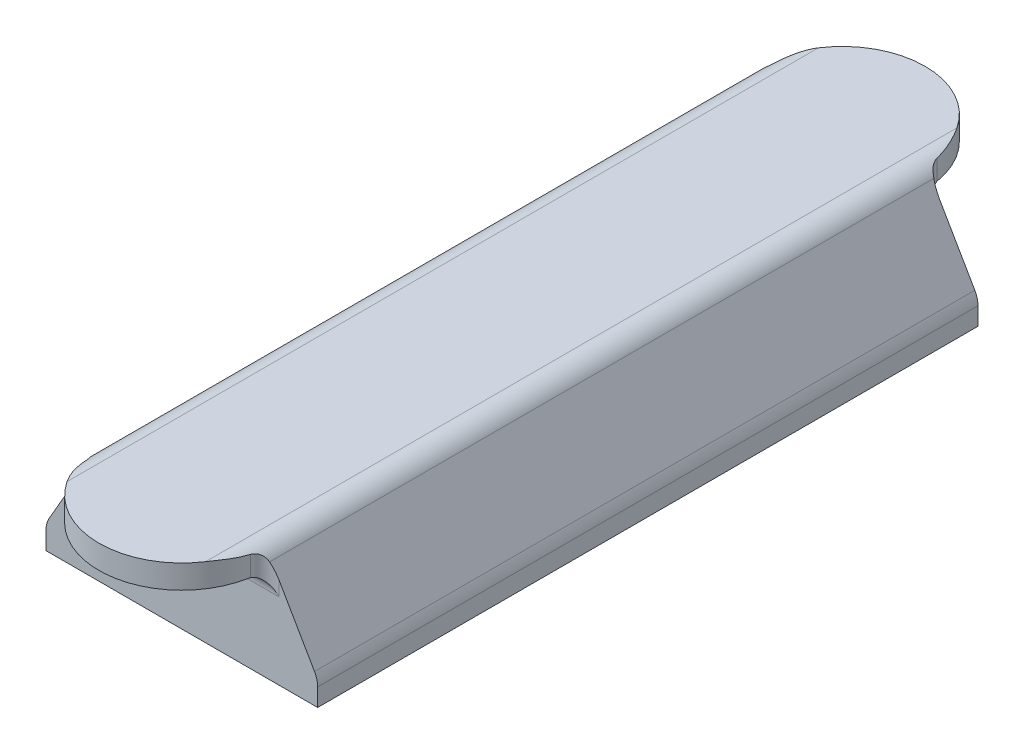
ISO-10303-21;
HEADER;
FILE_DESCRIPTION(('STEP AP214'),'2;1');
FILE_NAME('part.step','',(''),(''),'','','');
FILE_SCHEMA(('AUTOMOTIVE_DESIGN { 1 0 10303 214 1 1 1 1 }'));
ENDSEC;
DATA;
#1=APPLICATION_CONTEXT('core data for automotive mechanical design processes');
#2=APPLICATION_PROTOCOL_DEFINITION('international standard','automotive_design',2000,#1);
#3=PRODUCT_CONTEXT('',#1,'mechanical');
#4=PRODUCT('Part','Part','',(#3));
#5=PRODUCT_RELATED_PRODUCT_CATEGORY('part','',(#4));
#6=PRODUCT_DEFINITION_FORMATION('','',#4);
#7=PRODUCT_DEFINITION_CONTEXT('part definition',#1,'design');
#8=PRODUCT_DEFINITION('design','',#6,#7);
#9=PRODUCT_DEFINITION_SHAPE('','',#8);
#10=(LENGTH_UNIT() NAMED_UNIT(*) SI_UNIT(.MILLI.,.METRE.));
#11=(NAMED_UNIT(*) PLANE_ANGLE_UNIT() SI_UNIT($,.RADIAN.));
#12=(NAMED_UNIT(*) SI_UNIT($,.STERADIAN.) SOLID_ANGLE_UNIT());
#13=UNCERTAINTY_MEASURE_WITH_UNIT(LENGTH_MEASURE(1.E-05),#10,'distance_accuracy_value','');
#14=(GEOMETRIC_REPRESENTATION_CONTEXT(3) GLOBAL_UNCERTAINTY_ASSIGNED_CONTEXT((#13)) GLOBAL_UNIT_ASSIGNED_CONTEXT((#10,
#11,#12)) REPRESENTATION_CONTEXT('',''));
#15=CARTESIAN_POINT('',(0.,0.,0.));
#16=DIRECTION('',(0.,0.,1.));
#17=DIRECTION('',(1.,0.,0.));
#18=AXIS2_PLACEMENT_3D('',#15,#16,#17);
#19=CARTESIAN_POINT('',(0.,0.,8.));
#20=DIRECTION('',(0.866025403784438,-0.500000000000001,0.));
#21=DIRECTION('',(0.500000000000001,0.866025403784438,0.));
#22=AXIS2_PLACEMENT_3D('',#19,#20,#21);
#23=PLANE('',#22);
#24=DIRECTION('',(0.,0.,-1.));
#25=VECTOR('',#24,1.);
#26=CARTESIAN_POINT('',(-13.2790561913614,-23.,8.));
#27=LINE('',#26,#25);
#28=CARTESIAN_POINT('',(-13.2790561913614,-23.,7.));
#29=VERTEX_POINT('',#28);
#30=CARTESIAN_POINT('',(-13.2790561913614,-23.,-7.));
#31=VERTEX_POINT('',#30);
#32=EDGE_CURVE('E445',#29,#31,#27,.T.);
#33=ORIENTED_EDGE('',*,*,#32,.T.);
#34=DIRECTION('',(-0.500000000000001,-0.866025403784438,0.));
#35=VECTOR('',#34,1.);
#36=CARTESIAN_POINT('',(0.,0.,-7.));
#37=LINE('',#36,#35);
#38=CARTESIAN_POINT('',(-7.18261790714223,-12.4406591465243,-7.));
#39=VERTEX_POINT('',#38);
#40=EDGE_CURVE('E762',#31,#39,#37,.F.);
#41=ORIENTED_EDGE('',*,*,#40,.T.);
#42=DIRECTION('',(0.,0.,-1.));
#43=VECTOR('',#42,1.);
#44=CARTESIAN_POINT('',(-7.18261790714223,-12.4406591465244,8.));
#45=LINE('',#44,#43);
#46=CARTESIAN_POINT('',(-7.18261790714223,-12.4406591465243,7.));
#47=VERTEX_POINT('',#46);
#48=EDGE_CURVE('E759',#39,#47,#45,.F.);
#49=ORIENTED_EDGE('',*,*,#48,.T.);
#50=DIRECTION('',(-0.500000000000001,-0.866025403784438,0.));
#51=VECTOR('',#50,1.);
#52=CARTESIAN_POINT('',(0.,0.,7.));
#53=LINE('',#52,#51);
#54=EDGE_CURVE('E757',#47,#29,#53,.T.);
#55=ORIENTED_EDGE('',*,*,#54,.T.);
#56=EDGE_LOOP('',(#33,#41,#49,#55));
#57=FACE_BOUND('',#56,.T.);
#58=ADVANCED_FACE('F38',(#57),#23,.T.);
#59=CARTESIAN_POINT('',(0.,0.,8.));
#60=DIRECTION('',(0.,0.,-1.));
#61=DIRECTION('',(-1.,0.,0.));
#62=AXIS2_PLACEMENT_3D('',#59,#60,#61);
#63=CYLINDRICAL_SURFACE('',#62,13.4);
#64=CARTESIAN_POINT('',(0.,0.,7.));
#65=DIRECTION('',(0.,0.,1.));
#66=DIRECTION('',(1.,0.,0.));
#67=AXIS2_PLACEMENT_3D('',#64,#65,#66);
#68=CIRCLE('',#67,13.4);
#69=CARTESIAN_POINT('',(5.87794024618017,-12.042002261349,7.));
#70=VERTEX_POINT('',#69);
#71=CARTESIAN_POINT('',(-5.87794024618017,-12.042002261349,7.));
#72=VERTEX_POINT('',#71);
#73=EDGE_CURVE('E752',#70,#72,#68,.F.);
#74=ORIENTED_EDGE('',*,*,#73,.T.);
#75=DIRECTION('',(0.,0.,-1.));
#76=VECTOR('',#75,1.);
#77=CARTESIAN_POINT('',(-5.87794024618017,-12.042002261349,8.));
#78=LINE('',#77,#76);
#79=CARTESIAN_POINT('',(-5.87794024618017,-12.042002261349,-7.));
#80=VERTEX_POINT('',#79);
#81=EDGE_CURVE('E754',#72,#80,#78,.T.);
#82=ORIENTED_EDGE('',*,*,#81,.T.);
#83=CARTESIAN_POINT('',(0.,0.,-7.));
#84=DIRECTION('',(0.,0.,-1.));
#85=DIRECTION('',(-1.,0.,0.));
#86=AXIS2_PLACEMENT_3D('',#83,#84,#85);
#87=CIRCLE('',#86,13.4);
#88=CARTESIAN_POINT('',(5.87794024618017,-12.042002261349,-7.));
#89=VERTEX_POINT('',#88);
#90=EDGE_CURVE('E748',#80,#89,#87,.F.);
#91=ORIENTED_EDGE('',*,*,#90,.T.);
#92=DIRECTION('',(0.,0.,-1.));
#93=VECTOR('',#92,1.);
#94=CARTESIAN_POINT('',(5.87794024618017,-12.042002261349,8.));
#95=LINE('',#94,#93);
#96=EDGE_CURVE('E750',#89,#70,#95,.F.);
#97=ORIENTED_EDGE('',*,*,#96,.T.);
#98=EDGE_LOOP('',(#74,#82,#91,#97));
#99=FACE_BOUND('',#98,.T.);
#100=ADVANCED_FACE('F1085',(#99),#63,.T.);
#101=CARTESIAN_POINT('',(0.,0.,8.));
#102=DIRECTION('',(-0.866025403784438,-0.500000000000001,0.));
#103=DIRECTION('',(0.500000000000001,-0.866025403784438,0.));
#104=AXIS2_PLACEMENT_3D('',#101,#102,#103);
#105=PLANE('',#104);
#106=DIRECTION('',(0.,0.,-1.));
#107=VECTOR('',#106,1.);
#108=CARTESIAN_POINT('',(13.2790561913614,-23.,8.));
#109=LINE('',#108,#107);
#110=CARTESIAN_POINT('',(13.2790561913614,-23.,7.));
#111=VERTEX_POINT('',#110);
#112=CARTESIAN_POINT('',(13.2790561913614,-23.,-7.));
#113=VERTEX_POINT('',#112);
#114=EDGE_CURVE('E745',#111,#113,#109,.T.);
#115=ORIENTED_EDGE('',*,*,#114,.F.);
#116=DIRECTION('',(-0.500000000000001,0.866025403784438,0.));
#117=VECTOR('',#116,1.);
#118=CARTESIAN_POINT('',(0.,0.,7.));
#119=LINE('',#118,#117);
#120=CARTESIAN_POINT('',(7.18261790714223,-12.4406591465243,7.));
#121=VERTEX_POINT('',#120);
#122=EDGE_CURVE('E774',#111,#121,#119,.T.);
#123=ORIENTED_EDGE('',*,*,#122,.T.);
#124=DIRECTION('',(0.,0.,-1.));
#125=VECTOR('',#124,1.);
#126=CARTESIAN_POINT('',(7.18261790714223,-12.4406591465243,8.));
#127=LINE('',#126,#125);
#128=CARTESIAN_POINT('',(7.18261790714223,-12.4406591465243,-7.));
#129=VERTEX_POINT('',#128);
#130=EDGE_CURVE('E772',#121,#129,#127,.T.);
#131=ORIENTED_EDGE('',*,*,#130,.T.);
#132=DIRECTION('',(-0.500000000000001,0.866025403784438,0.));
#133=VECTOR('',#132,1.);
#134=CARTESIAN_POINT('',(0.,0.,-7.));
#135=LINE('',#134,#133);
#136=EDGE_CURVE('E770',#129,#113,#135,.F.);
#137=ORIENTED_EDGE('',*,*,#136,.T.);
#138=EDGE_LOOP('',(#115,#123,#131,#137));
#139=FACE_BOUND('',#138,.T.);
#140=ADVANCED_FACE('F1091',(#139),#105,.T.);
#141=CARTESIAN_POINT('',(17.2790561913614,0.,8.));
#142=DIRECTION('',(-1.,0.,0.));
#143=DIRECTION('',(0.,0.,1.));
#144=AXIS2_PLACEMENT_3D('',#141,#142,#143);
#145=PLANE('',#144);
#146=DIRECTION('',(0.,-1.,0.));
#147=VECTOR('',#146,1.);
#148=CARTESIAN_POINT('',(17.2790561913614,-19.9282032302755,-12.));
#149=LINE('',#148,#147);
#150=CARTESIAN_POINT('',(17.2790561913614,-20.7320508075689,-12.));
#151=VERTEX_POINT('',#150);
#152=CARTESIAN_POINT('',(17.2790561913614,-23.,-12.));
#153=VERTEX_POINT('',#152);
#154=EDGE_CURVE('E462',#151,#153,#149,.T.);
#155=ORIENTED_EDGE('',*,*,#154,.F.);
#156=DIRECTION('',(0.,0.,-1.));
#157=VECTOR('',#156,1.);
#158=CARTESIAN_POINT('',(17.2790561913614,-20.7320508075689,8.));
#159=LINE('',#158,#157);
#160=CARTESIAN_POINT('',(17.2790561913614,-20.7320508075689,72.));
#161=VERTEX_POINT('',#160);
#162=EDGE_CURVE('E1008',#151,#161,#159,.F.);
#163=ORIENTED_EDGE('',*,*,#162,.T.);
#164=DIRECTION('',(0.,1.,0.));
#165=VECTOR('',#164,1.);
#166=CARTESIAN_POINT('',(17.2790561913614,-23.,72.));
#167=LINE('',#166,#165);
#168=CARTESIAN_POINT('',(17.2790561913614,-23.,72.));
#169=VERTEX_POINT('',#168);
#170=EDGE_CURVE('E450',#169,#161,#167,.T.);
#171=ORIENTED_EDGE('',*,*,#170,.F.);
#172=DIRECTION('',(0.,0.,-1.));
#173=VECTOR('',#172,1.);
#174=CARTESIAN_POINT('',(17.2790561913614,-23.,8.));
#175=LINE('',#174,#173);
#176=EDGE_CURVE('E444',#169,#153,#175,.T.);
#177=ORIENTED_EDGE('',*,*,#176,.T.);
#178=EDGE_LOOP('',(#155,#163,#171,#177));
#179=FACE_BOUND('',#178,.T.);
#180=ADVANCED_FACE('F1077',(#179),#145,.F.);
#181=CARTESIAN_POINT('',(4.33012701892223,2.50000000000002,8.));
#182=DIRECTION('',(-0.866025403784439,-0.5,0.));
#183=DIRECTION('',(0.5,-0.866025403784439,0.));
#184=AXIS2_PLACEMENT_3D('',#181,#182,#183);
#185=PLANE('',#184);
#186=DIRECTION('',(-0.5,0.866025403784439,0.));
#187=VECTOR('',#186,1.);
#188=CARTESIAN_POINT('',(17.2790561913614,-19.9282032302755,72.));
#189=LINE('',#188,#187);
#190=CARTESIAN_POINT('',(16.8771324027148,-19.2320508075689,72.));
#191=VERTEX_POINT('',#190);
#192=CARTESIAN_POINT('',(12.38579895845,-11.452833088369,72.));
#193=VERTEX_POINT('',#192);
#194=EDGE_CURVE('E452',#191,#193,#189,.T.);
#195=ORIENTED_EDGE('',*,*,#194,.F.);
#196=DIRECTION('',(0.,0.,-1.));
#197=VECTOR('',#196,1.);
#198=CARTESIAN_POINT('',(16.8771324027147,-19.2320508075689,8.));
#199=LINE('',#198,#197);
#200=CARTESIAN_POINT('',(16.8771324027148,-19.2320508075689,-12.));
#201=VERTEX_POINT('',#200);
#202=EDGE_CURVE('E1014',#191,#201,#199,.T.);
#203=ORIENTED_EDGE('',*,*,#202,.T.);
#204=DIRECTION('',(0.5,-0.866025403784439,0.));
#205=VECTOR('',#204,1.);
#206=CARTESIAN_POINT('',(10.5462351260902,-8.26661506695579,-12.));
#207=LINE('',#206,#205);
#208=CARTESIAN_POINT('',(12.38579895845,-11.452833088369,-12.));
#209=VERTEX_POINT('',#208);
#210=EDGE_CURVE('E459',#209,#201,#207,.T.);
#211=ORIENTED_EDGE('',*,*,#210,.F.);
#212=CARTESIAN_POINT('',(12.38579895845,-11.452833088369,-14.));
#213=DIRECTION('',(-0.866025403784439,-0.5,0.));
#214=DIRECTION('',(-0.5,0.866025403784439,0.));
#215=AXIS2_PLACEMENT_3D('',#212,#213,#214);
#216=ELLIPSE('',#215,4.00000000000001,2.);
#217=CARTESIAN_POINT('',(11.4122605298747,-9.76661506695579,-12.2529387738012));
#218=VERTEX_POINT('',#217);
#219=EDGE_CURVE('E849',#209,#218,#216,.T.);
#220=ORIENTED_EDGE('',*,*,#219,.T.);
#221=DIRECTION('',(0.,0.,-1.));
#222=VECTOR('',#221,1.);
#223=CARTESIAN_POINT('',(11.4122605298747,-9.76661506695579,73.2151401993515));
#224=LINE('',#223,#222);
#225=CARTESIAN_POINT('',(11.4122605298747,-9.76661506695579,72.2529387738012));
#226=VERTEX_POINT('',#225);
#227=EDGE_CURVE('E960',#218,#226,#224,.F.);
#228=ORIENTED_EDGE('',*,*,#227,.T.);
#229=CARTESIAN_POINT('',(12.38579895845,-11.452833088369,74.));
#230=DIRECTION('',(-0.866025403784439,-0.5,0.));
#231=DIRECTION('',(-0.5,0.866025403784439,0.));
#232=AXIS2_PLACEMENT_3D('',#229,#230,#231);
#233=ELLIPSE('',#232,4.00000000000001,2.);
#234=EDGE_CURVE('E852',#226,#193,#233,.T.);
#235=ORIENTED_EDGE('',*,*,#234,.T.);
#236=EDGE_LOOP('',(#195,#203,#211,#220,#228,#235));
#237=FACE_BOUND('',#236,.T.);
#238=ADVANCED_FACE('F1046',(#237),#185,.F.);
#239=CARTESIAN_POINT('',(0.,-8.2666150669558,8.));
#240=DIRECTION('',(0.,1.,0.));
#241=DIRECTION('',(-1.,0.,0.));
#242=AXIS2_PLACEMENT_3D('',#239,#240,#241);
#243=PLANE('',#242);
#244=CARTESIAN_POINT('',(0.,-8.2666150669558,-12.));
#245=DIRECTION('',(0.,1.,0.));
#246=DIRECTION('',(-1.,0.,0.));
#247=AXIS2_PLACEMENT_3D('',#244,#245,#246);
#248=CIRCLE('',#247,10.5462351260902);
#249=CARTESIAN_POINT('',(8.81418431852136,-8.26661506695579,-17.7907883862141));
#250=VERTEX_POINT('',#249);
#251=CARTESIAN_POINT('',(-8.81418431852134,-8.26661506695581,-17.7907883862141));
#252=VERTEX_POINT('',#251);
#253=EDGE_CURVE('E1056',#250,#252,#248,.T.);
#254=ORIENTED_EDGE('',*,*,#253,.T.);
#255=DIRECTION('',(0.,0.,-1.));
#256=VECTOR('',#255,1.);
#257=CARTESIAN_POINT('',(-8.81418431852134,-8.26661506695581,73.2151401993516));
#258=LINE('',#257,#256);
#259=CARTESIAN_POINT('',(-8.81418431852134,-8.26661506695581,77.7907883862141));
#260=VERTEX_POINT('',#259);
#261=EDGE_CURVE('E895',#252,#260,#258,.F.);
#262=ORIENTED_EDGE('',*,*,#261,.T.);
#263=CARTESIAN_POINT('',(0.,-8.2666150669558,72.));
#264=DIRECTION('',(0.,1.,0.));
#265=DIRECTION('',(-1.,0.,0.));
#266=AXIS2_PLACEMENT_3D('',#263,#264,#265);
#267=CIRCLE('',#266,10.5462351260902);
#268=CARTESIAN_POINT('',(8.81418431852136,-8.26661506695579,77.7907883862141));
#269=VERTEX_POINT('',#268);
#270=EDGE_CURVE('E1025',#260,#269,#267,.T.);
#271=ORIENTED_EDGE('',*,*,#270,.T.);
#272=DIRECTION('',(0.,0.,-1.));
#273=VECTOR('',#272,1.);
#274=CARTESIAN_POINT('',(8.81418431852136,-8.26661506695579,-13.2151401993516));
#275=LINE('',#274,#273);
#276=EDGE_CURVE('E932',#269,#250,#275,.T.);
#277=ORIENTED_EDGE('',*,*,#276,.T.);
#278=EDGE_LOOP('',(#254,#262,#271,#277));
#279=FACE_BOUND('',#278,.T.);
#280=ADVANCED_FACE('F1053',(#279),#243,.T.);
#281=CARTESIAN_POINT('',(-4.3301270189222,2.5,8.));
#282=DIRECTION('',(0.866025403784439,-0.5,0.));
#283=DIRECTION('',(0.5,0.866025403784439,0.));
#284=AXIS2_PLACEMENT_3D('',#281,#282,#283);
#285=PLANE('',#284);
#286=DIRECTION('',(0.5,0.866025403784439,0.));
#287=VECTOR('',#286,1.);
#288=CARTESIAN_POINT('',(-17.2790561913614,-19.9282032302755,-12.));
#289=LINE('',#288,#287);
#290=CARTESIAN_POINT('',(-16.8771324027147,-19.2320508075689,-12.));
#291=VERTEX_POINT('',#290);
#292=CARTESIAN_POINT('',(-12.38579895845,-11.452833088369,-12.));
#293=VERTEX_POINT('',#292);
#294=EDGE_CURVE('E467',#291,#293,#289,.T.);
#295=ORIENTED_EDGE('',*,*,#294,.F.);
#296=DIRECTION('',(0.,0.,-1.));
#297=VECTOR('',#296,1.);
#298=CARTESIAN_POINT('',(-16.8771324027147,-19.2320508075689,72.));
#299=LINE('',#298,#297);
#300=CARTESIAN_POINT('',(-16.8771324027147,-19.2320508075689,72.));
#301=VERTEX_POINT('',#300);
#302=EDGE_CURVE('E1000',#291,#301,#299,.F.);
#303=ORIENTED_EDGE('',*,*,#302,.T.);
#304=DIRECTION('',(-0.5,-0.866025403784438,0.));
#305=VECTOR('',#304,1.);
#306=CARTESIAN_POINT('',(-10.5462351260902,-8.26661506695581,72.));
#307=LINE('',#306,#305);
#308=CARTESIAN_POINT('',(-12.38579895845,-11.452833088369,72.));
#309=VERTEX_POINT('',#308);
#310=EDGE_CURVE('E457',#309,#301,#307,.T.);
#311=ORIENTED_EDGE('',*,*,#310,.F.);
#312=CARTESIAN_POINT('',(-12.38579895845,-11.452833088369,74.));
#313=DIRECTION('',(0.866025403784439,-0.5,0.));
#314=DIRECTION('',(0.5,0.866025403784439,0.));
#315=AXIS2_PLACEMENT_3D('',#312,#313,#314);
#316=ELLIPSE('',#315,3.99999999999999,2.);
#317=CARTESIAN_POINT('',(-11.4122605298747,-9.76661506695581,72.2529387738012));
#318=VERTEX_POINT('',#317);
#319=EDGE_CURVE('E855',#309,#318,#316,.T.);
#320=ORIENTED_EDGE('',*,*,#319,.T.);
#321=DIRECTION('',(0.,0.,-1.));
#322=VECTOR('',#321,1.);
#323=CARTESIAN_POINT('',(-11.4122605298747,-9.76661506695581,-13.2151401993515));
#324=LINE('',#323,#322);
#325=CARTESIAN_POINT('',(-11.4122605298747,-9.76661506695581,-12.2529387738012));
#326=VERTEX_POINT('',#325);
#327=EDGE_CURVE('E997',#318,#326,#324,.T.);
#328=ORIENTED_EDGE('',*,*,#327,.T.);
#329=CARTESIAN_POINT('',(-12.38579895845,-11.452833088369,-14.));
#330=DIRECTION('',(0.866025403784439,-0.5,0.));
#331=DIRECTION('',(0.5,0.866025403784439,0.));
#332=AXIS2_PLACEMENT_3D('',#329,#330,#331);
#333=ELLIPSE('',#332,3.99999999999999,2.);
#334=EDGE_CURVE('E847',#326,#293,#333,.T.);
#335=ORIENTED_EDGE('',*,*,#334,.T.);
#336=EDGE_LOOP('',(#295,#303,#311,#320,#328,#335));
#337=FACE_BOUND('',#336,.T.);
#338=ADVANCED_FACE('F996',(#337),#285,.F.);
#339=CARTESIAN_POINT('',(-17.2790561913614,0.,8.));
#340=DIRECTION('',(-1.,0.,0.));
#341=DIRECTION('',(0.,0.,1.));
#342=AXIS2_PLACEMENT_3D('',#339,#340,#341);
#343=PLANE('',#342);
#344=DIRECTION('',(0.,-1.,0.));
#345=VECTOR('',#344,1.);
#346=CARTESIAN_POINT('',(-17.2790561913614,-19.9282032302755,72.));
#347=LINE('',#346,#345);
#348=CARTESIAN_POINT('',(-17.2790561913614,-20.7320508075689,72.));
#349=VERTEX_POINT('',#348);
#350=CARTESIAN_POINT('',(-17.2790561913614,-23.,72.));
#351=VERTEX_POINT('',#350);
#352=EDGE_CURVE('E421',#349,#351,#347,.T.);
#353=ORIENTED_EDGE('',*,*,#352,.F.);
#354=DIRECTION('',(0.,0.,-1.));
#355=VECTOR('',#354,1.);
#356=CARTESIAN_POINT('',(-17.2790561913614,-20.7320508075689,-12.));
#357=LINE('',#356,#355);
#358=CARTESIAN_POINT('',(-17.2790561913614,-20.7320508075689,-12.));
#359=VERTEX_POINT('',#358);
#360=EDGE_CURVE('E1001',#349,#359,#357,.T.);
#361=ORIENTED_EDGE('',*,*,#360,.T.);
#362=DIRECTION('',(0.,1.,0.));
#363=VECTOR('',#362,1.);
#364=CARTESIAN_POINT('',(-17.2790561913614,-23.,-12.));
#365=LINE('',#364,#363);
#366=CARTESIAN_POINT('',(-17.2790561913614,-23.,-12.));
#367=VERTEX_POINT('',#366);
#368=EDGE_CURVE('E440',#367,#359,#365,.T.);
#369=ORIENTED_EDGE('',*,*,#368,.F.);
#370=DIRECTION('',(0.,0.,-1.));
#371=VECTOR('',#370,1.);
#372=CARTESIAN_POINT('',(-17.2790561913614,-23.,8.));
#373=LINE('',#372,#371);
#374=EDGE_CURVE('E437',#351,#367,#373,.T.);
#375=ORIENTED_EDGE('',*,*,#374,.F.);
#376=EDGE_LOOP('',(#353,#361,#369,#375));
#377=FACE_BOUND('',#376,.T.);
#378=ADVANCED_FACE('F438',(#377),#343,.T.);
#379=CARTESIAN_POINT('',(0.,-23.,8.));
#380=DIRECTION('',(0.,1.,0.));
#381=DIRECTION('',(-1.,0.,0.));
#382=AXIS2_PLACEMENT_3D('',#379,#380,#381);
#383=PLANE('',#382);
#384=ORIENTED_EDGE('',*,*,#114,.T.);
#385=CARTESIAN_POINT('',(12.1243556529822,-23.,-7.));
#386=DIRECTION('',(0.,1.,0.));
#387=DIRECTION('',(-1.,0.,0.));
#388=AXIS2_PLACEMENT_3D('',#385,#386,#387);
#389=ELLIPSE('',#388,1.15470053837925,1.);
#390=CARTESIAN_POINT('',(12.1243556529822,-23.,-8.));
#391=VERTEX_POINT('',#390);
#392=EDGE_CURVE('E788',#113,#391,#389,.T.);
#393=ORIENTED_EDGE('',*,*,#392,.T.);
#394=DIRECTION('',(-1.,0.,0.));
#395=VECTOR('',#394,1.);
#396=CARTESIAN_POINT('',(0.,-23.,-8.));
#397=LINE('',#396,#395);
#398=CARTESIAN_POINT('',(-12.1243556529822,-23.,-8.));
#399=VERTEX_POINT('',#398);
#400=EDGE_CURVE('E735',#391,#399,#397,.T.);
#401=ORIENTED_EDGE('',*,*,#400,.T.);
#402=CARTESIAN_POINT('',(-12.1243556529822,-23.,-7.));
#403=DIRECTION('',(0.,1.,0.));
#404=DIRECTION('',(-1.,0.,0.));
#405=AXIS2_PLACEMENT_3D('',#402,#403,#404);
#406=ELLIPSE('',#405,1.15470053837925,1.);
#407=EDGE_CURVE('E782',#399,#31,#406,.T.);
#408=ORIENTED_EDGE('',*,*,#407,.T.);
#409=ORIENTED_EDGE('',*,*,#32,.F.);
#410=CARTESIAN_POINT('',(-12.1243556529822,-23.,7.));
#411=DIRECTION('',(0.,1.,0.));
#412=DIRECTION('',(-1.,0.,0.));
#413=AXIS2_PLACEMENT_3D('',#410,#411,#412);
#414=ELLIPSE('',#413,1.15470053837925,1.);
#415=CARTESIAN_POINT('',(-12.1243556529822,-23.,8.));
#416=VERTEX_POINT('',#415);
#417=EDGE_CURVE('E784',#29,#416,#414,.T.);
#418=ORIENTED_EDGE('',*,*,#417,.T.);
#419=DIRECTION('',(1.,0.,0.));
#420=VECTOR('',#419,1.);
#421=CARTESIAN_POINT('',(0.,-23.,8.));
#422=LINE('',#421,#420);
#423=CARTESIAN_POINT('',(12.1243556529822,-23.,8.));
#424=VERTEX_POINT('',#423);
#425=EDGE_CURVE('E738',#416,#424,#422,.T.);
#426=ORIENTED_EDGE('',*,*,#425,.T.);
#427=CARTESIAN_POINT('',(12.1243556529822,-23.,7.));
#428=DIRECTION('',(0.,1.,0.));
#429=DIRECTION('',(-1.,0.,0.));
#430=AXIS2_PLACEMENT_3D('',#427,#428,#429);
#431=ELLIPSE('',#430,1.15470053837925,1.);
#432=EDGE_CURVE('E786',#424,#111,#431,.T.);
#433=ORIENTED_EDGE('',*,*,#432,.T.);
#434=EDGE_LOOP('',(#384,#393,#401,#408,#409,#418,#426,#433));
#435=FACE_BOUND('',#434,.T.);
#436=ORIENTED_EDGE('',*,*,#374,.T.);
#437=DIRECTION('',(-1.,0.,0.));
#438=VECTOR('',#437,1.);
#439=CARTESIAN_POINT('',(17.2790561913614,-23.,-12.));
#440=LINE('',#439,#438);
#441=EDGE_CURVE('E464',#153,#367,#440,.T.);
#442=ORIENTED_EDGE('',*,*,#441,.F.);
#443=ORIENTED_EDGE('',*,*,#176,.F.);
#444=DIRECTION('',(1.,0.,0.));
#445=VECTOR('',#444,1.);
#446=CARTESIAN_POINT('',(-17.2790561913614,-23.,72.));
#447=LINE('',#446,#445);
#448=EDGE_CURVE('E426',#351,#169,#447,.T.);
#449=ORIENTED_EDGE('',*,*,#448,.F.);
#450=EDGE_LOOP('',(#436,#442,#443,#449));
#451=FACE_BOUND('',#450,.T.);
#452=DIRECTION('',(0.,0.,-1.));
#453=VECTOR('',#452,1.);
#454=CARTESIAN_POINT('',(13.2790561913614,-23.,28.));
#455=LINE('',#454,#453);
#456=CARTESIAN_POINT('',(13.2790561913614,-23.,27.));
#457=VERTEX_POINT('',#456);
#458=CARTESIAN_POINT('',(13.2790561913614,-23.,13.));
#459=VERTEX_POINT('',#458);
#460=EDGE_CURVE('E657',#457,#459,#455,.T.);
#461=ORIENTED_EDGE('',*,*,#460,.T.);
#462=CARTESIAN_POINT('',(12.1243556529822,-23.,13.));
#463=DIRECTION('',(0.,1.,0.));
#464=DIRECTION('',(-1.,0.,0.));
#465=AXIS2_PLACEMENT_3D('',#462,#463,#464);
#466=ELLIPSE('',#465,1.15470053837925,1.);
#467=CARTESIAN_POINT('',(12.1243556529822,-23.,12.));
#468=VERTEX_POINT('',#467);
#469=EDGE_CURVE('E700',#459,#468,#466,.T.);
#470=ORIENTED_EDGE('',*,*,#469,.T.);
#471=DIRECTION('',(-1.,0.,0.));
#472=VECTOR('',#471,1.);
#473=CARTESIAN_POINT('',(0.,-23.,12.));
#474=LINE('',#473,#472);
#475=CARTESIAN_POINT('',(-12.1243556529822,-23.,12.));
#476=VERTEX_POINT('',#475);
#477=EDGE_CURVE('E647',#468,#476,#474,.T.);
#478=ORIENTED_EDGE('',*,*,#477,.T.);
#479=CARTESIAN_POINT('',(-12.1243556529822,-23.,13.));
#480=DIRECTION('',(0.,1.,0.));
#481=DIRECTION('',(-1.,0.,0.));
#482=AXIS2_PLACEMENT_3D('',#479,#480,#481);
#483=ELLIPSE('',#482,1.15470053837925,1.);
#484=CARTESIAN_POINT('',(-13.2790561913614,-23.,13.));
#485=VERTEX_POINT('',#484);
#486=EDGE_CURVE('E694',#476,#485,#483,.T.);
#487=ORIENTED_EDGE('',*,*,#486,.T.);
#488=DIRECTION('',(0.,0.,-1.));
#489=VECTOR('',#488,1.);
#490=CARTESIAN_POINT('',(-13.2790561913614,-23.,28.));
#491=LINE('',#490,#489);
#492=CARTESIAN_POINT('',(-13.2790561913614,-23.,27.));
#493=VERTEX_POINT('',#492);
#494=EDGE_CURVE('E654',#493,#485,#491,.T.);
#495=ORIENTED_EDGE('',*,*,#494,.F.);
#496=CARTESIAN_POINT('',(-12.1243556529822,-23.,27.));
#497=DIRECTION('',(0.,1.,0.));
#498=DIRECTION('',(-1.,0.,0.));
#499=AXIS2_PLACEMENT_3D('',#496,#497,#498);
#500=ELLIPSE('',#499,1.15470053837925,1.);
#501=CARTESIAN_POINT('',(-12.1243556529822,-23.,28.));
#502=VERTEX_POINT('',#501);
#503=EDGE_CURVE('E696',#493,#502,#500,.T.);
#504=ORIENTED_EDGE('',*,*,#503,.T.);
#505=DIRECTION('',(1.,0.,0.));
#506=VECTOR('',#505,1.);
#507=CARTESIAN_POINT('',(0.,-23.,28.));
#508=LINE('',#507,#506);
#509=CARTESIAN_POINT('',(12.1243556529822,-23.,28.));
#510=VERTEX_POINT('',#509);
#511=EDGE_CURVE('E650',#502,#510,#508,.T.);
#512=ORIENTED_EDGE('',*,*,#511,.T.);
#513=CARTESIAN_POINT('',(12.1243556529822,-23.,27.));
#514=DIRECTION('',(0.,1.,0.));
#515=DIRECTION('',(-1.,0.,0.));
#516=AXIS2_PLACEMENT_3D('',#513,#514,#515);
#517=ELLIPSE('',#516,1.15470053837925,1.);
#518=EDGE_CURVE('E698',#510,#457,#517,.T.);
#519=ORIENTED_EDGE('',*,*,#518,.T.);
#520=EDGE_LOOP('',(#461,#470,#478,#487,#495,#504,#512,#519));
#521=FACE_BOUND('',#520,.T.);
#522=DIRECTION('',(0.,0.,-1.));
#523=VECTOR('',#522,1.);
#524=CARTESIAN_POINT('',(13.2790561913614,-23.,68.));
#525=LINE('',#524,#523);
#526=CARTESIAN_POINT('',(13.2790561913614,-23.,67.));
#527=VERTEX_POINT('',#526);
#528=CARTESIAN_POINT('',(13.2790561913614,-23.,53.));
#529=VERTEX_POINT('',#528);
#530=EDGE_CURVE('E481',#527,#529,#525,.T.);
#531=ORIENTED_EDGE('',*,*,#530,.T.);
#532=CARTESIAN_POINT('',(12.1243556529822,-23.,53.));
#533=DIRECTION('',(0.,1.,0.));
#534=DIRECTION('',(-1.,0.,0.));
#535=AXIS2_PLACEMENT_3D('',#532,#533,#534);
#536=ELLIPSE('',#535,1.15470053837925,1.);
#537=CARTESIAN_POINT('',(12.1243556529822,-23.,52.));
#538=VERTEX_POINT('',#537);
#539=EDGE_CURVE('E524',#529,#538,#536,.T.);
#540=ORIENTED_EDGE('',*,*,#539,.T.);
#541=DIRECTION('',(-1.,0.,0.));
#542=VECTOR('',#541,1.);
#543=CARTESIAN_POINT('',(0.,-23.,52.));
#544=LINE('',#543,#542);
#545=CARTESIAN_POINT('',(-12.1243556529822,-23.,52.));
#546=VERTEX_POINT('',#545);
#547=EDGE_CURVE('E471',#538,#546,#544,.T.);
#548=ORIENTED_EDGE('',*,*,#547,.T.);
#549=CARTESIAN_POINT('',(-12.1243556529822,-23.,53.));
#550=DIRECTION('',(0.,1.,0.));
#551=DIRECTION('',(-1.,0.,0.));
#552=AXIS2_PLACEMENT_3D('',#549,#550,#551);
#553=ELLIPSE('',#552,1.15470053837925,1.);
#554=CARTESIAN_POINT('',(-13.2790561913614,-23.,53.));
#555=VERTEX_POINT('',#554);
#556=EDGE_CURVE('E518',#546,#555,#553,.T.);
#557=ORIENTED_EDGE('',*,*,#556,.T.);
#558=DIRECTION('',(0.,0.,-1.));
#559=VECTOR('',#558,1.);
#560=CARTESIAN_POINT('',(-13.2790561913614,-23.,68.));
#561=LINE('',#560,#559);
#562=CARTESIAN_POINT('',(-13.2790561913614,-23.,67.));
#563=VERTEX_POINT('',#562);
#564=EDGE_CURVE('E478',#563,#555,#561,.T.);
#565=ORIENTED_EDGE('',*,*,#564,.F.);
#566=CARTESIAN_POINT('',(-12.1243556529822,-23.,67.));
#567=DIRECTION('',(0.,1.,0.));
#568=DIRECTION('',(-1.,0.,0.));
#569=AXIS2_PLACEMENT_3D('',#566,#567,#568);
#570=ELLIPSE('',#569,1.15470053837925,1.);
#571=CARTESIAN_POINT('',(-12.1243556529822,-23.,68.));
#572=VERTEX_POINT('',#571);
#573=EDGE_CURVE('E520',#563,#572,#570,.T.);
#574=ORIENTED_EDGE('',*,*,#573,.T.);
#575=DIRECTION('',(1.,0.,0.));
#576=VECTOR('',#575,1.);
#577=CARTESIAN_POINT('',(0.,-23.,68.));
#578=LINE('',#577,#576);
#579=CARTESIAN_POINT('',(12.1243556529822,-23.,68.));
#580=VERTEX_POINT('',#579);
#581=EDGE_CURVE('E474',#572,#580,#578,.T.);
#582=ORIENTED_EDGE('',*,*,#581,.T.);
#583=CARTESIAN_POINT('',(12.1243556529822,-23.,67.));
#584=DIRECTION('',(0.,1.,0.));
#585=DIRECTION('',(-1.,0.,0.));
#586=AXIS2_PLACEMENT_3D('',#583,#584,#585);
#587=ELLIPSE('',#586,1.15470053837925,1.);
#588=EDGE_CURVE('E522',#580,#527,#587,.T.);
#589=ORIENTED_EDGE('',*,*,#588,.T.);
#590=EDGE_LOOP('',(#531,#540,#548,#557,#565,#574,#582,#589));
#591=FACE_BOUND('',#590,.T.);
#592=DIRECTION('',(0.,0.,-1.));
#593=VECTOR('',#592,1.);
#594=CARTESIAN_POINT('',(13.2790561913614,-23.,48.));
#595=LINE('',#594,#593);
#596=CARTESIAN_POINT('',(13.2790561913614,-23.,47.));
#597=VERTEX_POINT('',#596);
#598=CARTESIAN_POINT('',(13.2790561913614,-23.,33.));
#599=VERTEX_POINT('',#598);
#600=EDGE_CURVE('E569',#597,#599,#595,.T.);
#601=ORIENTED_EDGE('',*,*,#600,.T.);
#602=CARTESIAN_POINT('',(12.1243556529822,-23.,33.));
#603=DIRECTION('',(0.,1.,0.));
#604=DIRECTION('',(-1.,0.,0.));
#605=AXIS2_PLACEMENT_3D('',#602,#603,#604);
#606=ELLIPSE('',#605,1.15470053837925,1.);
#607=CARTESIAN_POINT('',(12.1243556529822,-23.,32.));
#608=VERTEX_POINT('',#607);
#609=EDGE_CURVE('E612',#599,#608,#606,.T.);
#610=ORIENTED_EDGE('',*,*,#609,.T.);
#611=DIRECTION('',(-1.,0.,0.));
#612=VECTOR('',#611,1.);
#613=CARTESIAN_POINT('',(0.,-23.,32.));
#614=LINE('',#613,#612);
#615=CARTESIAN_POINT('',(-12.1243556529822,-23.,32.));
#616=VERTEX_POINT('',#615);
#617=EDGE_CURVE('E559',#608,#616,#614,.T.);
#618=ORIENTED_EDGE('',*,*,#617,.T.);
#619=CARTESIAN_POINT('',(-12.1243556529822,-23.,33.));
#620=DIRECTION('',(0.,1.,0.));
#621=DIRECTION('',(-1.,0.,0.));
#622=AXIS2_PLACEMENT_3D('',#619,#620,#621);
#623=ELLIPSE('',#622,1.15470053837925,1.);
#624=CARTESIAN_POINT('',(-13.2790561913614,-23.,33.));
#625=VERTEX_POINT('',#624);
#626=EDGE_CURVE('E606',#616,#625,#623,.T.);
#627=ORIENTED_EDGE('',*,*,#626,.T.);
#628=DIRECTION('',(0.,0.,-1.));
#629=VECTOR('',#628,1.);
#630=CARTESIAN_POINT('',(-13.2790561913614,-23.,48.));
#631=LINE('',#630,#629);
#632=CARTESIAN_POINT('',(-13.2790561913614,-23.,47.));
#633=VERTEX_POINT('',#632);
#634=EDGE_CURVE('E566',#633,#625,#631,.T.);
#635=ORIENTED_EDGE('',*,*,#634,.F.);
#636=CARTESIAN_POINT('',(-12.1243556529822,-23.,47.));
#637=DIRECTION('',(0.,1.,0.));
#638=DIRECTION('',(-1.,0.,0.));
#639=AXIS2_PLACEMENT_3D('',#636,#637,#638);
#640=ELLIPSE('',#639,1.15470053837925,1.);
#641=CARTESIAN_POINT('',(-12.1243556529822,-23.,48.));
#642=VERTEX_POINT('',#641);
#643=EDGE_CURVE('E608',#633,#642,#640,.T.);
#644=ORIENTED_EDGE('',*,*,#643,.T.);
#645=DIRECTION('',(1.,0.,0.));
#646=VECTOR('',#645,1.);
#647=CARTESIAN_POINT('',(0.,-23.,48.));
#648=LINE('',#647,#646);
#649=CARTESIAN_POINT('',(12.1243556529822,-23.,48.));
#650=VERTEX_POINT('',#649);
#651=EDGE_CURVE('E562',#642,#650,#648,.T.);
#652=ORIENTED_EDGE('',*,*,#651,.T.);
#653=CARTESIAN_POINT('',(12.1243556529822,-23.,47.));
#654=DIRECTION('',(0.,1.,0.));
#655=DIRECTION('',(-1.,0.,0.));
#656=AXIS2_PLACEMENT_3D('',#653,#654,#655);
#657=ELLIPSE('',#656,1.15470053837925,1.);
#658=EDGE_CURVE('E610',#650,#597,#657,.T.);
#659=ORIENTED_EDGE('',*,*,#658,.T.);
#660=EDGE_LOOP('',(#601,#610,#618,#627,#635,#644,#652,#659));
#661=FACE_BOUND('',#660,.T.);
#662=ADVANCED_FACE('F447',(#435,#451,#521,#591,#661),#383,.F.);
#663=CARTESIAN_POINT('',(0.,0.,8.));
#664=DIRECTION('',(0.,0.,1.));
#665=DIRECTION('',(1.,0.,0.));
#666=AXIS2_PLACEMENT_3D('',#663,#664,#665);
#667=PLANE('',#666);
#668=ORIENTED_EDGE('',*,*,#425,.F.);
#669=DIRECTION('',(-0.500000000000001,-0.866025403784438,0.));
#670=VECTOR('',#669,1.);
#671=CARTESIAN_POINT('',(0.866025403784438,-0.500000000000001,8.));
#672=LINE('',#671,#670);
#673=CARTESIAN_POINT('',(-6.31659250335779,-12.9406591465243,8.));
#674=VERTEX_POINT('',#673);
#675=EDGE_CURVE('E768',#416,#674,#672,.F.);
#676=ORIENTED_EDGE('',*,*,#675,.T.);
#677=CARTESIAN_POINT('',(0.,0.,8.));
#678=DIRECTION('',(0.,0.,1.));
#679=DIRECTION('',(1.,0.,0.));
#680=AXIS2_PLACEMENT_3D('',#677,#678,#679);
#681=CIRCLE('',#680,14.4);
#682=CARTESIAN_POINT('',(6.31659250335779,-12.9406591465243,8.));
#683=VERTEX_POINT('',#682);
#684=EDGE_CURVE('E766',#674,#683,#681,.T.);
#685=ORIENTED_EDGE('',*,*,#684,.T.);
#686=DIRECTION('',(-0.500000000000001,0.866025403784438,0.));
#687=VECTOR('',#686,1.);
#688=CARTESIAN_POINT('',(-0.866025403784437,-0.500000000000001,8.));
#689=LINE('',#688,#687);
#690=EDGE_CURVE('E764',#683,#424,#689,.F.);
#691=ORIENTED_EDGE('',*,*,#690,.T.);
#692=EDGE_LOOP('',(#668,#676,#685,#691));
#693=FACE_BOUND('',#692,.T.);
#694=ADVANCED_FACE('F1147',(#693),#667,.F.);
#695=CARTESIAN_POINT('',(0.,0.,-8.));
#696=DIRECTION('',(0.,0.,-1.));
#697=DIRECTION('',(-1.,0.,0.));
#698=AXIS2_PLACEMENT_3D('',#695,#696,#697);
#699=PLANE('',#698);
#700=CARTESIAN_POINT('',(0.,0.,-8.));
#701=DIRECTION('',(0.,0.,-1.));
#702=DIRECTION('',(-1.,0.,0.));
#703=AXIS2_PLACEMENT_3D('',#700,#701,#702);
#704=CIRCLE('',#703,14.4);
#705=CARTESIAN_POINT('',(6.31659250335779,-12.9406591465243,-8.));
#706=VERTEX_POINT('',#705);
#707=CARTESIAN_POINT('',(-6.31659250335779,-12.9406591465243,-8.));
#708=VERTEX_POINT('',#707);
#709=EDGE_CURVE('E778',#706,#708,#704,.T.);
#710=ORIENTED_EDGE('',*,*,#709,.T.);
#711=DIRECTION('',(-0.500000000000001,-0.866025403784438,0.));
#712=VECTOR('',#711,1.);
#713=CARTESIAN_POINT('',(0.866025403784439,-0.500000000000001,-8.));
#714=LINE('',#713,#712);
#715=EDGE_CURVE('E780',#708,#399,#714,.T.);
#716=ORIENTED_EDGE('',*,*,#715,.T.);
#717=ORIENTED_EDGE('',*,*,#400,.F.);
#718=DIRECTION('',(-0.500000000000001,0.866025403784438,0.));
#719=VECTOR('',#718,1.);
#720=CARTESIAN_POINT('',(-0.866025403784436,-0.5,-8.));
#721=LINE('',#720,#719);
#722=EDGE_CURVE('E776',#391,#706,#721,.T.);
#723=ORIENTED_EDGE('',*,*,#722,.T.);
#724=EDGE_LOOP('',(#710,#716,#717,#723));
#725=FACE_BOUND('',#724,.T.);
#726=ADVANCED_FACE('F1142',(#725),#699,.F.);
#727=CARTESIAN_POINT('',(-0.866025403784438,-0.500000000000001,7.));
#728=DIRECTION('',(-0.500000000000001,0.866025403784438,0.));
#729=DIRECTION('',(-0.866025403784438,-0.500000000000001,0.));
#730=AXIS2_PLACEMENT_3D('',#727,#728,#729);
#731=CYLINDRICAL_SURFACE('',#730,1.);
#732=ORIENTED_EDGE('',*,*,#432,.F.);
#733=ORIENTED_EDGE('',*,*,#690,.F.);
#734=CARTESIAN_POINT('',(6.31659250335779,-12.9406591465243,7.));
#735=DIRECTION('',(0.5,-0.866025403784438,0.));
#736=DIRECTION('',(0.866025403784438,0.5,0.));
#737=AXIS2_PLACEMENT_3D('',#734,#735,#736);
#738=CIRCLE('',#737,1.);
#739=EDGE_CURVE('E739',#121,#683,#738,.T.);
#740=ORIENTED_EDGE('',*,*,#739,.F.);
#741=ORIENTED_EDGE('',*,*,#122,.F.);
#742=EDGE_LOOP('',(#732,#733,#740,#741));
#743=FACE_BOUND('',#742,.T.);
#744=ADVANCED_FACE('F1139',(#743),#731,.F.);
#745=CARTESIAN_POINT('',(6.31659250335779,-12.9406591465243,8.));
#746=DIRECTION('',(0.,0.,-1.));
#747=DIRECTION('',(-1.,0.,0.));
#748=AXIS2_PLACEMENT_3D('',#745,#746,#747);
#749=CYLINDRICAL_SURFACE('',#748,1.);
#750=CARTESIAN_POINT('',(6.31659250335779,-12.9406591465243,-7.));
#751=DIRECTION('',(0.,0.,1.));
#752=DIRECTION('',(0.,-1.,0.));
#753=AXIS2_PLACEMENT_3D('',#750,#751,#752);
#754=CIRCLE('',#753,1.);
#755=EDGE_CURVE('E815',#129,#89,#754,.T.);
#756=ORIENTED_EDGE('',*,*,#755,.F.);
#757=ORIENTED_EDGE('',*,*,#130,.F.);
#758=CARTESIAN_POINT('',(6.31659250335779,-12.9406591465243,7.));
#759=DIRECTION('',(0.,0.,-1.));
#760=DIRECTION('',(-1.,0.,0.));
#761=AXIS2_PLACEMENT_3D('',#758,#759,#760);
#762=CIRCLE('',#761,1.);
#763=EDGE_CURVE('E818',#70,#121,#762,.T.);
#764=ORIENTED_EDGE('',*,*,#763,.F.);
#765=ORIENTED_EDGE('',*,*,#96,.F.);
#766=EDGE_LOOP('',(#756,#757,#764,#765));
#767=FACE_BOUND('',#766,.T.);
#768=ADVANCED_FACE('F1136',(#767),#749,.F.);
#769=CARTESIAN_POINT('',(-0.866025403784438,-0.500000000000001,-7.));
#770=DIRECTION('',(-0.500000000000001,0.866025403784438,0.));
#771=DIRECTION('',(-0.866025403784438,-0.500000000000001,0.));
#772=AXIS2_PLACEMENT_3D('',#769,#770,#771);
#773=CYLINDRICAL_SURFACE('',#772,1.);
#774=ORIENTED_EDGE('',*,*,#392,.F.);
#775=ORIENTED_EDGE('',*,*,#136,.F.);
#776=CARTESIAN_POINT('',(6.31659250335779,-12.9406591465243,-7.));
#777=DIRECTION('',(0.499999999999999,-0.866025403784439,0.));
#778=DIRECTION('',(0.866025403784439,0.499999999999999,0.));
#779=AXIS2_PLACEMENT_3D('',#776,#777,#778);
#780=CIRCLE('',#779,1.);
#781=EDGE_CURVE('E812',#706,#129,#780,.T.);
#782=ORIENTED_EDGE('',*,*,#781,.F.);
#783=ORIENTED_EDGE('',*,*,#722,.F.);
#784=EDGE_LOOP('',(#774,#775,#782,#783));
#785=FACE_BOUND('',#784,.T.);
#786=ADVANCED_FACE('F1132',(#785),#773,.F.);
#787=CARTESIAN_POINT('',(6.31659250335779,-12.9406591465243,7.));
#788=DIRECTION('',(0.,0.,1.));
#789=DIRECTION('',(0.,-1.,0.));
#790=AXIS2_PLACEMENT_3D('',#787,#788,#789);
#791=SPHERICAL_SURFACE('',#790,1.);
#792=ORIENTED_EDGE('',*,*,#763,.T.);
#793=ORIENTED_EDGE('',*,*,#739,.T.);
#794=CARTESIAN_POINT('',(6.31659250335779,-12.9406591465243,7.));
#795=DIRECTION('',(-0.898656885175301,-0.438652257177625,0.));
#796=DIRECTION('',(0.438652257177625,-0.898656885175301,0.));
#797=AXIS2_PLACEMENT_3D('',#794,#795,#796);
#798=CIRCLE('',#797,1.);
#799=EDGE_CURVE('E809',#70,#683,#798,.F.);
#800=ORIENTED_EDGE('',*,*,#799,.F.);
#801=EDGE_LOOP('',(#792,#793,#800));
#802=FACE_BOUND('',#801,.T.);
#803=ADVANCED_FACE('F1128',(#802),#791,.F.);
#804=CARTESIAN_POINT('',(6.31659250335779,-12.9406591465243,-7.));
#805=DIRECTION('',(0.,0.,-1.));
#806=DIRECTION('',(0.,1.,0.));
#807=AXIS2_PLACEMENT_3D('',#804,#805,#806);
#808=SPHERICAL_SURFACE('',#807,1.);
#809=ORIENTED_EDGE('',*,*,#781,.T.);
#810=ORIENTED_EDGE('',*,*,#755,.T.);
#811=CARTESIAN_POINT('',(6.31659250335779,-12.9406591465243,-7.));
#812=DIRECTION('',(-0.898656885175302,-0.438652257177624,0.));
#813=DIRECTION('',(0.438652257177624,-0.898656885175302,0.));
#814=AXIS2_PLACEMENT_3D('',#811,#812,#813);
#815=CIRCLE('',#814,1.);
#816=EDGE_CURVE('E806',#706,#89,#815,.F.);
#817=ORIENTED_EDGE('',*,*,#816,.F.);
#818=EDGE_LOOP('',(#809,#810,#817));
#819=FACE_BOUND('',#818,.T.);
#820=ADVANCED_FACE('F1124',(#819),#808,.F.);
#821=CARTESIAN_POINT('',(0.866025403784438,-0.500000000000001,7.));
#822=DIRECTION('',(-0.500000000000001,-0.866025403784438,0.));
#823=DIRECTION('',(0.866025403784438,-0.500000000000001,0.));
#824=AXIS2_PLACEMENT_3D('',#821,#822,#823);
#825=CYLINDRICAL_SURFACE('',#824,1.);
#826=ORIENTED_EDGE('',*,*,#417,.F.);
#827=ORIENTED_EDGE('',*,*,#54,.F.);
#828=CARTESIAN_POINT('',(-6.31659250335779,-12.9406591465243,7.));
#829=DIRECTION('',(-0.499999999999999,-0.866025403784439,0.));
#830=DIRECTION('',(0.866025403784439,-0.499999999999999,0.));
#831=AXIS2_PLACEMENT_3D('',#828,#829,#830);
#832=CIRCLE('',#831,1.);
#833=EDGE_CURVE('E803',#674,#47,#832,.T.);
#834=ORIENTED_EDGE('',*,*,#833,.F.);
#835=ORIENTED_EDGE('',*,*,#675,.F.);
#836=EDGE_LOOP('',(#826,#827,#834,#835));
#837=FACE_BOUND('',#836,.T.);
#838=ADVANCED_FACE('F1120',(#837),#825,.F.);
#839=CARTESIAN_POINT('',(0.,0.,7.));
#840=DIRECTION('',(0.,0.,1.));
#841=DIRECTION('',(1.,0.,0.));
#842=AXIS2_PLACEMENT_3D('',#839,#840,#841);
#843=TOROIDAL_SURFACE('',#842,14.4,1.);
#844=ORIENTED_EDGE('',*,*,#799,.T.);
#845=ORIENTED_EDGE('',*,*,#684,.F.);
#846=CARTESIAN_POINT('',(-6.31659250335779,-12.9406591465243,7.));
#847=DIRECTION('',(0.898656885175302,-0.438652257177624,0.));
#848=DIRECTION('',(0.438652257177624,0.898656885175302,0.));
#849=AXIS2_PLACEMENT_3D('',#846,#847,#848);
#850=CIRCLE('',#849,1.);
#851=EDGE_CURVE('E800',#72,#674,#850,.T.);
#852=ORIENTED_EDGE('',*,*,#851,.F.);
#853=ORIENTED_EDGE('',*,*,#73,.F.);
#854=EDGE_LOOP('',(#844,#845,#852,#853));
#855=FACE_BOUND('',#854,.T.);
#856=ADVANCED_FACE('F1116',(#855),#843,.F.);
#857=CARTESIAN_POINT('',(0.,0.,-7.));
#858=DIRECTION('',(0.,0.,-1.));
#859=DIRECTION('',(-1.,0.,0.));
#860=AXIS2_PLACEMENT_3D('',#857,#858,#859);
#861=TOROIDAL_SURFACE('',#860,14.4,1.);
#862=ORIENTED_EDGE('',*,*,#816,.T.);
#863=ORIENTED_EDGE('',*,*,#90,.F.);
#864=CARTESIAN_POINT('',(-6.31659250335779,-12.9406591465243,-7.));
#865=DIRECTION('',(0.898656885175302,-0.438652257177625,0.));
#866=DIRECTION('',(0.438652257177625,0.898656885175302,0.));
#867=AXIS2_PLACEMENT_3D('',#864,#865,#866);
#868=CIRCLE('',#867,1.);
#869=EDGE_CURVE('E797',#708,#80,#868,.T.);
#870=ORIENTED_EDGE('',*,*,#869,.F.);
#871=ORIENTED_EDGE('',*,*,#709,.F.);
#872=EDGE_LOOP('',(#862,#863,#870,#871));
#873=FACE_BOUND('',#872,.T.);
#874=ADVANCED_FACE('F1112',(#873),#861,.F.);
#875=CARTESIAN_POINT('',(0.866025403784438,-0.500000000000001,-7.));
#876=DIRECTION('',(-0.500000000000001,-0.866025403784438,0.));
#877=DIRECTION('',(0.866025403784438,-0.500000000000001,0.));
#878=AXIS2_PLACEMENT_3D('',#875,#876,#877);
#879=CYLINDRICAL_SURFACE('',#878,1.);
#880=ORIENTED_EDGE('',*,*,#407,.F.);
#881=ORIENTED_EDGE('',*,*,#715,.F.);
#882=CARTESIAN_POINT('',(-6.31659250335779,-12.9406591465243,-7.));
#883=DIRECTION('',(-0.5,-0.866025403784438,0.));
#884=DIRECTION('',(0.866025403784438,-0.5,0.));
#885=AXIS2_PLACEMENT_3D('',#882,#883,#884);
#886=CIRCLE('',#885,1.);
#887=EDGE_CURVE('E794',#39,#708,#886,.T.);
#888=ORIENTED_EDGE('',*,*,#887,.F.);
#889=ORIENTED_EDGE('',*,*,#40,.F.);
#890=EDGE_LOOP('',(#880,#881,#888,#889));
#891=FACE_BOUND('',#890,.T.);
#892=ADVANCED_FACE('F1108',(#891),#879,.F.);
#893=CARTESIAN_POINT('',(-6.31659250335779,-12.9406591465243,7.));
#894=DIRECTION('',(0.,0.,1.));
#895=DIRECTION('',(1.,0.,0.));
#896=AXIS2_PLACEMENT_3D('',#893,#894,#895);
#897=SPHERICAL_SURFACE('',#896,1.);
#898=ORIENTED_EDGE('',*,*,#851,.T.);
#899=ORIENTED_EDGE('',*,*,#833,.T.);
#900=CARTESIAN_POINT('',(-6.31659250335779,-12.9406591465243,7.));
#901=DIRECTION('',(0.,0.,-1.));
#902=DIRECTION('',(-1.,0.,0.));
#903=AXIS2_PLACEMENT_3D('',#900,#901,#902);
#904=CIRCLE('',#903,1.);
#905=EDGE_CURVE('E792',#72,#47,#904,.F.);
#906=ORIENTED_EDGE('',*,*,#905,.F.);
#907=EDGE_LOOP('',(#898,#899,#906));
#908=FACE_BOUND('',#907,.T.);
#909=ADVANCED_FACE('F1104',(#908),#897,.F.);
#910=CARTESIAN_POINT('',(-6.31659250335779,-12.9406591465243,-7.));
#911=DIRECTION('',(0.,0.,-1.));
#912=DIRECTION('',(-1.,0.,0.));
#913=AXIS2_PLACEMENT_3D('',#910,#911,#912);
#914=SPHERICAL_SURFACE('',#913,1.);
#915=ORIENTED_EDGE('',*,*,#887,.T.);
#916=ORIENTED_EDGE('',*,*,#869,.T.);
#917=CARTESIAN_POINT('',(-6.31659250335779,-12.9406591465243,-7.));
#918=DIRECTION('',(0.,0.,1.));
#919=DIRECTION('',(1.,0.,0.));
#920=AXIS2_PLACEMENT_3D('',#917,#918,#919);
#921=CIRCLE('',#920,1.);
#922=EDGE_CURVE('E702',#39,#80,#921,.F.);
#923=ORIENTED_EDGE('',*,*,#922,.F.);
#924=EDGE_LOOP('',(#915,#916,#923));
#925=FACE_BOUND('',#924,.T.);
#926=ADVANCED_FACE('F1100',(#925),#914,.F.);
#927=CARTESIAN_POINT('',(-6.31659250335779,-12.9406591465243,8.));
#928=DIRECTION('',(0.,0.,-1.));
#929=DIRECTION('',(-1.,0.,0.));
#930=AXIS2_PLACEMENT_3D('',#927,#928,#929);
#931=CYLINDRICAL_SURFACE('',#930,1.);
#932=ORIENTED_EDGE('',*,*,#905,.T.);
#933=ORIENTED_EDGE('',*,*,#48,.F.);
#934=ORIENTED_EDGE('',*,*,#922,.T.);
#935=ORIENTED_EDGE('',*,*,#81,.F.);
#936=EDGE_LOOP('',(#932,#933,#934,#935));
#937=FACE_BOUND('',#936,.T.);
#938=ADVANCED_FACE('F1096',(#937),#931,.F.);
#939=CARTESIAN_POINT('',(0.,0.,28.));
#940=DIRECTION('',(0.866025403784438,-0.500000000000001,0.));
#941=DIRECTION('',(0.500000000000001,0.866025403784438,0.));
#942=AXIS2_PLACEMENT_3D('',#939,#940,#941);
#943=PLANE('',#942);
#944=ORIENTED_EDGE('',*,*,#494,.T.);
#945=DIRECTION('',(-0.500000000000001,-0.866025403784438,0.));
#946=VECTOR('',#945,1.);
#947=CARTESIAN_POINT('',(0.,0.,13.));
#948=LINE('',#947,#946);
#949=CARTESIAN_POINT('',(-7.18261790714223,-12.4406591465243,13.));
#950=VERTEX_POINT('',#949);
#951=EDGE_CURVE('E674',#485,#950,#948,.F.);
#952=ORIENTED_EDGE('',*,*,#951,.T.);
#953=DIRECTION('',(0.,0.,-1.));
#954=VECTOR('',#953,1.);
#955=CARTESIAN_POINT('',(-7.18261790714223,-12.4406591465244,28.));
#956=LINE('',#955,#954);
#957=CARTESIAN_POINT('',(-7.18261790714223,-12.4406591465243,27.));
#958=VERTEX_POINT('',#957);
#959=EDGE_CURVE('E671',#950,#958,#956,.F.);
#960=ORIENTED_EDGE('',*,*,#959,.T.);
#961=DIRECTION('',(-0.500000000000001,-0.866025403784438,0.));
#962=VECTOR('',#961,1.);
#963=CARTESIAN_POINT('',(0.,0.,27.));
#964=LINE('',#963,#962);
#965=EDGE_CURVE('E669',#958,#493,#964,.T.);
#966=ORIENTED_EDGE('',*,*,#965,.T.);
#967=EDGE_LOOP('',(#944,#952,#960,#966));
#968=FACE_BOUND('',#967,.T.);
#969=ADVANCED_FACE('F1099',(#968),#943,.T.);
#970=CARTESIAN_POINT('',(0.,0.,28.));
#971=DIRECTION('',(0.,0.,-1.));
#972=DIRECTION('',(-1.,0.,0.));
#973=AXIS2_PLACEMENT_3D('',#970,#971,#972);
#974=CYLINDRICAL_SURFACE('',#973,13.4);
#975=CARTESIAN_POINT('',(0.,0.,27.));
#976=DIRECTION('',(0.,0.,1.));
#977=DIRECTION('',(1.,0.,0.));
#978=AXIS2_PLACEMENT_3D('',#975,#976,#977);
#979=CIRCLE('',#978,13.4);
#980=CARTESIAN_POINT('',(5.87794024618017,-12.042002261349,27.));
#981=VERTEX_POINT('',#980);
#982=CARTESIAN_POINT('',(-5.87794024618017,-12.042002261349,27.));
#983=VERTEX_POINT('',#982);
#984=EDGE_CURVE('E664',#981,#983,#979,.F.);
#985=ORIENTED_EDGE('',*,*,#984,.T.);
#986=DIRECTION('',(0.,0.,-1.));
#987=VECTOR('',#986,1.);
#988=CARTESIAN_POINT('',(-5.87794024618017,-12.042002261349,28.));
#989=LINE('',#988,#987);
#990=CARTESIAN_POINT('',(-5.87794024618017,-12.042002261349,13.));
#991=VERTEX_POINT('',#990);
#992=EDGE_CURVE('E666',#983,#991,#989,.T.);
#993=ORIENTED_EDGE('',*,*,#992,.T.);
#994=CARTESIAN_POINT('',(0.,0.,13.));
#995=DIRECTION('',(0.,0.,-1.));
#996=DIRECTION('',(-1.,0.,0.));
#997=AXIS2_PLACEMENT_3D('',#994,#995,#996);
#998=CIRCLE('',#997,13.4);
#999=CARTESIAN_POINT('',(5.87794024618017,-12.042002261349,13.));
#1000=VERTEX_POINT('',#999);
#1001=EDGE_CURVE('E660',#991,#1000,#998,.F.);
#1002=ORIENTED_EDGE('',*,*,#1001,.T.);
#1003=DIRECTION('',(0.,0.,-1.));
#1004=VECTOR('',#1003,1.);
#1005=CARTESIAN_POINT('',(5.87794024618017,-12.042002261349,28.));
#1006=LINE('',#1005,#1004);
#1007=EDGE_CURVE('E662',#1000,#981,#1006,.F.);
#1008=ORIENTED_EDGE('',*,*,#1007,.T.);
#1009=EDGE_LOOP('',(#985,#993,#1002,#1008));
#1010=FACE_BOUND('',#1009,.T.);
#1011=ADVANCED_FACE('F1690',(#1010),#974,.T.);
#1012=CARTESIAN_POINT('',(0.,0.,28.));
#1013=DIRECTION('',(-0.866025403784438,-0.500000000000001,0.));
#1014=DIRECTION('',(0.500000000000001,-0.866025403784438,0.));
#1015=AXIS2_PLACEMENT_3D('',#1012,#1013,#1014);
#1016=PLANE('',#1015);
#1017=ORIENTED_EDGE('',*,*,#460,.F.);
#1018=DIRECTION('',(-0.500000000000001,0.866025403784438,0.));
#1019=VECTOR('',#1018,1.);
#1020=CARTESIAN_POINT('',(0.,0.,27.));
#1021=LINE('',#1020,#1019);
#1022=CARTESIAN_POINT('',(7.18261790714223,-12.4406591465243,27.));
#1023=VERTEX_POINT('',#1022);
#1024=EDGE_CURVE('E686',#457,#1023,#1021,.T.);
#1025=ORIENTED_EDGE('',*,*,#1024,.T.);
#1026=DIRECTION('',(0.,0.,-1.));
#1027=VECTOR('',#1026,1.);
#1028=CARTESIAN_POINT('',(7.18261790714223,-12.4406591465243,28.));
#1029=LINE('',#1028,#1027);
#1030=CARTESIAN_POINT('',(7.18261790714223,-12.4406591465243,13.));
#1031=VERTEX_POINT('',#1030);
#1032=EDGE_CURVE('E684',#1023,#1031,#1029,.T.);
#1033=ORIENTED_EDGE('',*,*,#1032,.T.);
#1034=DIRECTION('',(-0.500000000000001,0.866025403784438,0.));
#1035=VECTOR('',#1034,1.);
#1036=CARTESIAN_POINT('',(0.,0.,13.));
#1037=LINE('',#1036,#1035);
#1038=EDGE_CURVE('E682',#1031,#459,#1037,.F.);
#1039=ORIENTED_EDGE('',*,*,#1038,.T.);
#1040=EDGE_LOOP('',(#1017,#1025,#1033,#1039));
#1041=FACE_BOUND('',#1040,.T.);
#1042=ADVANCED_FACE('F1683',(#1041),#1016,.T.);
#1043=CARTESIAN_POINT('',(0.,0.,28.));
#1044=DIRECTION('',(0.,0.,1.));
#1045=DIRECTION('',(1.,0.,0.));
#1046=AXIS2_PLACEMENT_3D('',#1043,#1044,#1045);
#1047=PLANE('',#1046);
#1048=ORIENTED_EDGE('',*,*,#511,.F.);
#1049=DIRECTION('',(-0.500000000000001,-0.866025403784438,0.));
#1050=VECTOR('',#1049,1.);
#1051=CARTESIAN_POINT('',(0.866025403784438,-0.500000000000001,28.));
#1052=LINE('',#1051,#1050);
#1053=CARTESIAN_POINT('',(-6.31659250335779,-12.9406591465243,28.));
#1054=VERTEX_POINT('',#1053);
#1055=EDGE_CURVE('E680',#502,#1054,#1052,.F.);
#1056=ORIENTED_EDGE('',*,*,#1055,.T.);
#1057=CARTESIAN_POINT('',(0.,0.,28.));
#1058=DIRECTION('',(0.,0.,1.));
#1059=DIRECTION('',(1.,0.,0.));
#1060=AXIS2_PLACEMENT_3D('',#1057,#1058,#1059);
#1061=CIRCLE('',#1060,14.4);
#1062=CARTESIAN_POINT('',(6.31659250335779,-12.9406591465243,28.));
#1063=VERTEX_POINT('',#1062);
#1064=EDGE_CURVE('E678',#1054,#1063,#1061,.T.);
#1065=ORIENTED_EDGE('',*,*,#1064,.T.);
#1066=DIRECTION('',(-0.500000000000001,0.866025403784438,0.));
#1067=VECTOR('',#1066,1.);
#1068=CARTESIAN_POINT('',(-0.866025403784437,-0.500000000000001,28.));
#1069=LINE('',#1068,#1067);
#1070=EDGE_CURVE('E676',#1063,#510,#1069,.F.);
#1071=ORIENTED_EDGE('',*,*,#1070,.T.);
#1072=EDGE_LOOP('',(#1048,#1056,#1065,#1071));
#1073=FACE_BOUND('',#1072,.T.);
#1074=ADVANCED_FACE('F1676',(#1073),#1047,.F.);
#1075=CARTESIAN_POINT('',(0.,0.,12.));
#1076=DIRECTION('',(0.,0.,-1.));
#1077=DIRECTION('',(-1.,0.,0.));
#1078=AXIS2_PLACEMENT_3D('',#1075,#1076,#1077);
#1079=PLANE('',#1078);
#1080=CARTESIAN_POINT('',(0.,0.,12.));
#1081=DIRECTION('',(0.,0.,-1.));
#1082=DIRECTION('',(-1.,0.,0.));
#1083=AXIS2_PLACEMENT_3D('',#1080,#1081,#1082);
#1084=CIRCLE('',#1083,14.4);
#1085=CARTESIAN_POINT('',(6.31659250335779,-12.9406591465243,12.));
#1086=VERTEX_POINT('',#1085);
#1087=CARTESIAN_POINT('',(-6.31659250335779,-12.9406591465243,12.));
#1088=VERTEX_POINT('',#1087);
#1089=EDGE_CURVE('E690',#1086,#1088,#1084,.T.);
#1090=ORIENTED_EDGE('',*,*,#1089,.T.);
#1091=DIRECTION('',(-0.500000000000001,-0.866025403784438,0.));
#1092=VECTOR('',#1091,1.);
#1093=CARTESIAN_POINT('',(0.866025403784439,-0.500000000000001,12.));
#1094=LINE('',#1093,#1092);
#1095=EDGE_CURVE('E692',#1088,#476,#1094,.T.);
#1096=ORIENTED_EDGE('',*,*,#1095,.T.);
#1097=ORIENTED_EDGE('',*,*,#477,.F.);
#1098=DIRECTION('',(-0.500000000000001,0.866025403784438,0.));
#1099=VECTOR('',#1098,1.);
#1100=CARTESIAN_POINT('',(-0.866025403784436,-0.5,12.));
#1101=LINE('',#1100,#1099);
#1102=EDGE_CURVE('E688',#468,#1086,#1101,.T.);
#1103=ORIENTED_EDGE('',*,*,#1102,.T.);
#1104=EDGE_LOOP('',(#1090,#1096,#1097,#1103));
#1105=FACE_BOUND('',#1104,.T.);
#1106=ADVANCED_FACE('F1670',(#1105),#1079,.F.);
#1107=CARTESIAN_POINT('',(-0.866025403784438,-0.500000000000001,27.));
#1108=DIRECTION('',(-0.500000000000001,0.866025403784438,0.));
#1109=DIRECTION('',(-0.866025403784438,-0.500000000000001,0.));
#1110=AXIS2_PLACEMENT_3D('',#1107,#1108,#1109);
#1111=CYLINDRICAL_SURFACE('',#1110,1.);
#1112=ORIENTED_EDGE('',*,*,#518,.F.);
#1113=ORIENTED_EDGE('',*,*,#1070,.F.);
#1114=CARTESIAN_POINT('',(6.31659250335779,-12.9406591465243,27.));
#1115=DIRECTION('',(0.5,-0.866025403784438,0.));
#1116=DIRECTION('',(0.866025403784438,0.5,0.));
#1117=AXIS2_PLACEMENT_3D('',#1114,#1115,#1116);
#1118=CIRCLE('',#1117,1.);
#1119=EDGE_CURVE('E651',#1023,#1063,#1118,.T.);
#1120=ORIENTED_EDGE('',*,*,#1119,.F.);
#1121=ORIENTED_EDGE('',*,*,#1024,.F.);
#1122=EDGE_LOOP('',(#1112,#1113,#1120,#1121));
#1123=FACE_BOUND('',#1122,.T.);
#1124=ADVANCED_FACE('F1663',(#1123),#1111,.F.);
#1125=CARTESIAN_POINT('',(6.31659250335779,-12.9406591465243,28.));
#1126=DIRECTION('',(0.,0.,-1.));
#1127=DIRECTION('',(-1.,0.,0.));
#1128=AXIS2_PLACEMENT_3D('',#1125,#1126,#1127);
#1129=CYLINDRICAL_SURFACE('',#1128,1.);
#1130=CARTESIAN_POINT('',(6.31659250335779,-12.9406591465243,13.));
#1131=DIRECTION('',(0.,0.,1.));
#1132=DIRECTION('',(0.,-1.,0.));
#1133=AXIS2_PLACEMENT_3D('',#1130,#1131,#1132);
#1134=CIRCLE('',#1133,1.);
#1135=EDGE_CURVE('E727',#1031,#1000,#1134,.T.);
#1136=ORIENTED_EDGE('',*,*,#1135,.F.);
#1137=ORIENTED_EDGE('',*,*,#1032,.F.);
#1138=CARTESIAN_POINT('',(6.31659250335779,-12.9406591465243,27.));
#1139=DIRECTION('',(0.,0.,-1.));
#1140=DIRECTION('',(-1.,0.,0.));
#1141=AXIS2_PLACEMENT_3D('',#1138,#1139,#1140);
#1142=CIRCLE('',#1141,1.);
#1143=EDGE_CURVE('E730',#981,#1023,#1142,.T.);
#1144=ORIENTED_EDGE('',*,*,#1143,.F.);
#1145=ORIENTED_EDGE('',*,*,#1007,.F.);
#1146=EDGE_LOOP('',(#1136,#1137,#1144,#1145));
#1147=FACE_BOUND('',#1146,.T.);
#1148=ADVANCED_FACE('F1656',(#1147),#1129,.F.);
#1149=CARTESIAN_POINT('',(-0.866025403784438,-0.500000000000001,13.));
#1150=DIRECTION('',(-0.500000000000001,0.866025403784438,0.));
#1151=DIRECTION('',(-0.866025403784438,-0.500000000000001,0.));
#1152=AXIS2_PLACEMENT_3D('',#1149,#1150,#1151);
#1153=CYLINDRICAL_SURFACE('',#1152,1.);
#1154=ORIENTED_EDGE('',*,*,#469,.F.);
#1155=ORIENTED_EDGE('',*,*,#1038,.F.);
#1156=CARTESIAN_POINT('',(6.31659250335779,-12.9406591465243,13.));
#1157=DIRECTION('',(0.499999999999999,-0.866025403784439,0.));
#1158=DIRECTION('',(0.866025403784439,0.499999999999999,0.));
#1159=AXIS2_PLACEMENT_3D('',#1156,#1157,#1158);
#1160=CIRCLE('',#1159,1.);
#1161=EDGE_CURVE('E724',#1086,#1031,#1160,.T.);
#1162=ORIENTED_EDGE('',*,*,#1161,.F.);
#1163=ORIENTED_EDGE('',*,*,#1102,.F.);
#1164=EDGE_LOOP('',(#1154,#1155,#1162,#1163));
#1165=FACE_BOUND('',#1164,.T.);
#1166=ADVANCED_FACE('F1649',(#1165),#1153,.F.);
#1167=CARTESIAN_POINT('',(6.31659250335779,-12.9406591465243,27.));
#1168=DIRECTION('',(0.,0.,1.));
#1169=DIRECTION('',(0.,-1.,0.));
#1170=AXIS2_PLACEMENT_3D('',#1167,#1168,#1169);
#1171=SPHERICAL_SURFACE('',#1170,1.);
#1172=ORIENTED_EDGE('',*,*,#1143,.T.);
#1173=ORIENTED_EDGE('',*,*,#1119,.T.);
#1174=CARTESIAN_POINT('',(6.31659250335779,-12.9406591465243,27.));
#1175=DIRECTION('',(-0.898656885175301,-0.438652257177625,0.));
#1176=DIRECTION('',(0.438652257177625,-0.898656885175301,0.));
#1177=AXIS2_PLACEMENT_3D('',#1174,#1175,#1176);
#1178=CIRCLE('',#1177,1.);
#1179=EDGE_CURVE('E721',#981,#1063,#1178,.F.);
#1180=ORIENTED_EDGE('',*,*,#1179,.F.);
#1181=EDGE_LOOP('',(#1172,#1173,#1180));
#1182=FACE_BOUND('',#1181,.T.);
#1183=ADVANCED_FACE('F1642',(#1182),#1171,.F.);
#1184=CARTESIAN_POINT('',(6.31659250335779,-12.9406591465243,13.));
#1185=DIRECTION('',(0.,0.,-1.));
#1186=DIRECTION('',(0.,1.,0.));
#1187=AXIS2_PLACEMENT_3D('',#1184,#1185,#1186);
#1188=SPHERICAL_SURFACE('',#1187,1.);
#1189=ORIENTED_EDGE('',*,*,#1161,.T.);
#1190=ORIENTED_EDGE('',*,*,#1135,.T.);
#1191=CARTESIAN_POINT('',(6.31659250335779,-12.9406591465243,13.));
#1192=DIRECTION('',(-0.898656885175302,-0.438652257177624,0.));
#1193=DIRECTION('',(0.438652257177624,-0.898656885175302,0.));
#1194=AXIS2_PLACEMENT_3D('',#1191,#1192,#1193);
#1195=CIRCLE('',#1194,1.);
#1196=EDGE_CURVE('E718',#1086,#1000,#1195,.F.);
#1197=ORIENTED_EDGE('',*,*,#1196,.F.);
#1198=EDGE_LOOP('',(#1189,#1190,#1197));
#1199=FACE_BOUND('',#1198,.T.);
#1200=ADVANCED_FACE('F1635',(#1199),#1188,.F.);
#1201=CARTESIAN_POINT('',(0.866025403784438,-0.500000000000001,27.));
#1202=DIRECTION('',(-0.500000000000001,-0.866025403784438,0.));
#1203=DIRECTION('',(0.866025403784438,-0.500000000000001,0.));
#1204=AXIS2_PLACEMENT_3D('',#1201,#1202,#1203);
#1205=CYLINDRICAL_SURFACE('',#1204,1.);
#1206=ORIENTED_EDGE('',*,*,#503,.F.);
#1207=ORIENTED_EDGE('',*,*,#965,.F.);
#1208=CARTESIAN_POINT('',(-6.31659250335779,-12.9406591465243,27.));
#1209=DIRECTION('',(-0.499999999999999,-0.866025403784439,0.));
#1210=DIRECTION('',(0.866025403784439,-0.499999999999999,0.));
#1211=AXIS2_PLACEMENT_3D('',#1208,#1209,#1210);
#1212=CIRCLE('',#1211,1.);
#1213=EDGE_CURVE('E715',#1054,#958,#1212,.T.);
#1214=ORIENTED_EDGE('',*,*,#1213,.F.);
#1215=ORIENTED_EDGE('',*,*,#1055,.F.);
#1216=EDGE_LOOP('',(#1206,#1207,#1214,#1215));
#1217=FACE_BOUND('',#1216,.T.);
#1218=ADVANCED_FACE('F1628',(#1217),#1205,.F.);
#1219=CARTESIAN_POINT('',(0.,0.,27.));
#1220=DIRECTION('',(0.,0.,1.));
#1221=DIRECTION('',(1.,0.,0.));
#1222=AXIS2_PLACEMENT_3D('',#1219,#1220,#1221);
#1223=TOROIDAL_SURFACE('',#1222,14.4,1.);
#1224=ORIENTED_EDGE('',*,*,#1179,.T.);
#1225=ORIENTED_EDGE('',*,*,#1064,.F.);
#1226=CARTESIAN_POINT('',(-6.31659250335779,-12.9406591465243,27.));
#1227=DIRECTION('',(0.898656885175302,-0.438652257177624,0.));
#1228=DIRECTION('',(0.438652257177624,0.898656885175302,0.));
#1229=AXIS2_PLACEMENT_3D('',#1226,#1227,#1228);
#1230=CIRCLE('',#1229,1.);
#1231=EDGE_CURVE('E712',#983,#1054,#1230,.T.);
#1232=ORIENTED_EDGE('',*,*,#1231,.F.);
#1233=ORIENTED_EDGE('',*,*,#984,.F.);
#1234=EDGE_LOOP('',(#1224,#1225,#1232,#1233));
#1235=FACE_BOUND('',#1234,.T.);
#1236=ADVANCED_FACE('F1621',(#1235),#1223,.F.);
#1237=CARTESIAN_POINT('',(0.,0.,13.));
#1238=DIRECTION('',(0.,0.,-1.));
#1239=DIRECTION('',(-1.,0.,0.));
#1240=AXIS2_PLACEMENT_3D('',#1237,#1238,#1239);
#1241=TOROIDAL_SURFACE('',#1240,14.4,1.);
#1242=ORIENTED_EDGE('',*,*,#1196,.T.);
#1243=ORIENTED_EDGE('',*,*,#1001,.F.);
#1244=CARTESIAN_POINT('',(-6.31659250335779,-12.9406591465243,13.));
#1245=DIRECTION('',(0.898656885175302,-0.438652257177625,0.));
#1246=DIRECTION('',(0.438652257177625,0.898656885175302,0.));
#1247=AXIS2_PLACEMENT_3D('',#1244,#1245,#1246);
#1248=CIRCLE('',#1247,1.);
#1249=EDGE_CURVE('E709',#1088,#991,#1248,.T.);
#1250=ORIENTED_EDGE('',*,*,#1249,.F.);
#1251=ORIENTED_EDGE('',*,*,#1089,.F.);
#1252=EDGE_LOOP('',(#1242,#1243,#1250,#1251));
#1253=FACE_BOUND('',#1252,.T.);
#1254=ADVANCED_FACE('F1614',(#1253),#1241,.F.);
#1255=CARTESIAN_POINT('',(0.866025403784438,-0.500000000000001,13.));
#1256=DIRECTION('',(-0.500000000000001,-0.866025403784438,0.));
#1257=DIRECTION('',(0.866025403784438,-0.500000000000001,0.));
#1258=AXIS2_PLACEMENT_3D('',#1255,#1256,#1257);
#1259=CYLINDRICAL_SURFACE('',#1258,1.);
#1260=ORIENTED_EDGE('',*,*,#486,.F.);
#1261=ORIENTED_EDGE('',*,*,#1095,.F.);
#1262=CARTESIAN_POINT('',(-6.31659250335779,-12.9406591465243,13.));
#1263=DIRECTION('',(-0.5,-0.866025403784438,0.));
#1264=DIRECTION('',(0.866025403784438,-0.5,0.));
#1265=AXIS2_PLACEMENT_3D('',#1262,#1263,#1264);
#1266=CIRCLE('',#1265,1.);
#1267=EDGE_CURVE('E706',#950,#1088,#1266,.T.);
#1268=ORIENTED_EDGE('',*,*,#1267,.F.);
#1269=ORIENTED_EDGE('',*,*,#951,.F.);
#1270=EDGE_LOOP('',(#1260,#1261,#1268,#1269));
#1271=FACE_BOUND('',#1270,.T.);
#1272=ADVANCED_FACE('F1607',(#1271),#1259,.F.);
#1273=CARTESIAN_POINT('',(-6.31659250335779,-12.9406591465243,27.));
#1274=DIRECTION('',(0.,0.,1.));
#1275=DIRECTION('',(1.,0.,0.));
#1276=AXIS2_PLACEMENT_3D('',#1273,#1274,#1275);
#1277=SPHERICAL_SURFACE('',#1276,1.);
#1278=ORIENTED_EDGE('',*,*,#1231,.T.);
#1279=ORIENTED_EDGE('',*,*,#1213,.T.);
#1280=CARTESIAN_POINT('',(-6.31659250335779,-12.9406591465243,27.));
#1281=DIRECTION('',(0.,0.,-1.));
#1282=DIRECTION('',(-1.,0.,0.));
#1283=AXIS2_PLACEMENT_3D('',#1280,#1281,#1282);
#1284=CIRCLE('',#1283,1.);
#1285=EDGE_CURVE('E704',#983,#958,#1284,.F.);
#1286=ORIENTED_EDGE('',*,*,#1285,.F.);
#1287=EDGE_LOOP('',(#1278,#1279,#1286));
#1288=FACE_BOUND('',#1287,.T.);
#1289=ADVANCED_FACE('F1600',(#1288),#1277,.F.);
#1290=CARTESIAN_POINT('',(-6.31659250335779,-12.9406591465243,13.));
#1291=DIRECTION('',(0.,0.,-1.));
#1292=DIRECTION('',(-1.,0.,0.));
#1293=AXIS2_PLACEMENT_3D('',#1290,#1291,#1292);
#1294=SPHERICAL_SURFACE('',#1293,1.);
#1295=ORIENTED_EDGE('',*,*,#1267,.T.);
#1296=ORIENTED_EDGE('',*,*,#1249,.T.);
#1297=CARTESIAN_POINT('',(-6.31659250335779,-12.9406591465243,13.));
#1298=DIRECTION('',(0.,0.,1.));
#1299=DIRECTION('',(1.,0.,0.));
#1300=AXIS2_PLACEMENT_3D('',#1297,#1298,#1299);
#1301=CIRCLE('',#1300,1.);
#1302=EDGE_CURVE('E614',#950,#991,#1301,.F.);
#1303=ORIENTED_EDGE('',*,*,#1302,.F.);
#1304=EDGE_LOOP('',(#1295,#1296,#1303));
#1305=FACE_BOUND('',#1304,.T.);
#1306=ADVANCED_FACE('F1593',(#1305),#1294,.F.);
#1307=CARTESIAN_POINT('',(-6.31659250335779,-12.9406591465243,28.));
#1308=DIRECTION('',(0.,0.,-1.));
#1309=DIRECTION('',(-1.,0.,0.));
#1310=AXIS2_PLACEMENT_3D('',#1307,#1308,#1309);
#1311=CYLINDRICAL_SURFACE('',#1310,1.);
#1312=ORIENTED_EDGE('',*,*,#1285,.T.);
#1313=ORIENTED_EDGE('',*,*,#959,.F.);
#1314=ORIENTED_EDGE('',*,*,#1302,.T.);
#1315=ORIENTED_EDGE('',*,*,#992,.F.);
#1316=EDGE_LOOP('',(#1312,#1313,#1314,#1315));
#1317=FACE_BOUND('',#1316,.T.);
#1318=ADVANCED_FACE('F1586',(#1317),#1311,.F.);
#1319=CARTESIAN_POINT('',(0.,0.,48.));
#1320=DIRECTION('',(0.866025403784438,-0.500000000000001,0.));
#1321=DIRECTION('',(0.500000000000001,0.866025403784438,0.));
#1322=AXIS2_PLACEMENT_3D('',#1319,#1320,#1321);
#1323=PLANE('',#1322);
#1324=ORIENTED_EDGE('',*,*,#634,.T.);
#1325=DIRECTION('',(-0.500000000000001,-0.866025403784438,0.));
#1326=VECTOR('',#1325,1.);
#1327=CARTESIAN_POINT('',(0.,0.,33.));
#1328=LINE('',#1327,#1326);
#1329=CARTESIAN_POINT('',(-7.18261790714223,-12.4406591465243,33.));
#1330=VERTEX_POINT('',#1329);
#1331=EDGE_CURVE('E586',#625,#1330,#1328,.F.);
#1332=ORIENTED_EDGE('',*,*,#1331,.T.);
#1333=DIRECTION('',(0.,0.,-1.));
#1334=VECTOR('',#1333,1.);
#1335=CARTESIAN_POINT('',(-7.18261790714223,-12.4406591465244,48.));
#1336=LINE('',#1335,#1334);
#1337=CARTESIAN_POINT('',(-7.18261790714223,-12.4406591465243,47.));
#1338=VERTEX_POINT('',#1337);
#1339=EDGE_CURVE('E583',#1330,#1338,#1336,.F.);
#1340=ORIENTED_EDGE('',*,*,#1339,.T.);
#1341=DIRECTION('',(-0.500000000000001,-0.866025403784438,0.));
#1342=VECTOR('',#1341,1.);
#1343=CARTESIAN_POINT('',(0.,0.,47.));
#1344=LINE('',#1343,#1342);
#1345=EDGE_CURVE('E581',#1338,#633,#1344,.T.);
#1346=ORIENTED_EDGE('',*,*,#1345,.T.);
#1347=EDGE_LOOP('',(#1324,#1332,#1340,#1346));
#1348=FACE_BOUND('',#1347,.T.);
#1349=ADVANCED_FACE('F1579',(#1348),#1323,.T.);
#1350=CARTESIAN_POINT('',(0.,0.,48.));
#1351=DIRECTION('',(0.,0.,-1.));
#1352=DIRECTION('',(-1.,0.,0.));
#1353=AXIS2_PLACEMENT_3D('',#1350,#1351,#1352);
#1354=CYLINDRICAL_SURFACE('',#1353,13.4);
#1355=CARTESIAN_POINT('',(0.,0.,47.));
#1356=DIRECTION('',(0.,0.,1.));
#1357=DIRECTION('',(1.,0.,0.));
#1358=AXIS2_PLACEMENT_3D('',#1355,#1356,#1357);
#1359=CIRCLE('',#1358,13.4);
#1360=CARTESIAN_POINT('',(5.87794024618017,-12.042002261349,47.));
#1361=VERTEX_POINT('',#1360);
#1362=CARTESIAN_POINT('',(-5.87794024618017,-12.042002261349,47.));
#1363=VERTEX_POINT('',#1362);
#1364=EDGE_CURVE('E576',#1361,#1363,#1359,.F.);
#1365=ORIENTED_EDGE('',*,*,#1364,.T.);
#1366=DIRECTION('',(0.,0.,-1.));
#1367=VECTOR('',#1366,1.);
#1368=CARTESIAN_POINT('',(-5.87794024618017,-12.042002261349,48.));
#1369=LINE('',#1368,#1367);
#1370=CARTESIAN_POINT('',(-5.87794024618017,-12.042002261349,33.));
#1371=VERTEX_POINT('',#1370);
#1372=EDGE_CURVE('E578',#1363,#1371,#1369,.T.);
#1373=ORIENTED_EDGE('',*,*,#1372,.T.);
#1374=CARTESIAN_POINT('',(0.,0.,33.));
#1375=DIRECTION('',(0.,0.,-1.));
#1376=DIRECTION('',(-1.,0.,0.));
#1377=AXIS2_PLACEMENT_3D('',#1374,#1375,#1376);
#1378=CIRCLE('',#1377,13.4);
#1379=CARTESIAN_POINT('',(5.87794024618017,-12.042002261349,33.));
#1380=VERTEX_POINT('',#1379);
#1381=EDGE_CURVE('E572',#1371,#1380,#1378,.F.);
#1382=ORIENTED_EDGE('',*,*,#1381,.T.);
#1383=DIRECTION('',(0.,0.,-1.));
#1384=VECTOR('',#1383,1.);
#1385=CARTESIAN_POINT('',(5.87794024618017,-12.042002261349,48.));
#1386=LINE('',#1385,#1384);
#1387=EDGE_CURVE('E574',#1380,#1361,#1386,.F.);
#1388=ORIENTED_EDGE('',*,*,#1387,.T.);
#1389=EDGE_LOOP('',(#1365,#1373,#1382,#1388));
#1390=FACE_BOUND('',#1389,.T.);
#1391=ADVANCED_FACE('F1572',(#1390),#1354,.T.);
#1392=CARTESIAN_POINT('',(0.,0.,48.));
#1393=DIRECTION('',(-0.866025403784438,-0.500000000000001,0.));
#1394=DIRECTION('',(0.500000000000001,-0.866025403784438,0.));
#1395=AXIS2_PLACEMENT_3D('',#1392,#1393,#1394);
#1396=PLANE('',#1395);
#1397=ORIENTED_EDGE('',*,*,#600,.F.);
#1398=DIRECTION('',(-0.500000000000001,0.866025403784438,0.));
#1399=VECTOR('',#1398,1.);
#1400=CARTESIAN_POINT('',(0.,0.,47.));
#1401=LINE('',#1400,#1399);
#1402=CARTESIAN_POINT('',(7.18261790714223,-12.4406591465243,47.));
#1403=VERTEX_POINT('',#1402);
#1404=EDGE_CURVE('E598',#597,#1403,#1401,.T.);
#1405=ORIENTED_EDGE('',*,*,#1404,.T.);
#1406=DIRECTION('',(0.,0.,-1.));
#1407=VECTOR('',#1406,1.);
#1408=CARTESIAN_POINT('',(7.18261790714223,-12.4406591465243,48.));
#1409=LINE('',#1408,#1407);
#1410=CARTESIAN_POINT('',(7.18261790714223,-12.4406591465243,33.));
#1411=VERTEX_POINT('',#1410);
#1412=EDGE_CURVE('E596',#1403,#1411,#1409,.T.);
#1413=ORIENTED_EDGE('',*,*,#1412,.T.);
#1414=DIRECTION('',(-0.500000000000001,0.866025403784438,0.));
#1415=VECTOR('',#1414,1.);
#1416=CARTESIAN_POINT('',(0.,0.,33.));
#1417=LINE('',#1416,#1415);
#1418=EDGE_CURVE('E594',#1411,#599,#1417,.F.);
#1419=ORIENTED_EDGE('',*,*,#1418,.T.);
#1420=EDGE_LOOP('',(#1397,#1405,#1413,#1419));
#1421=FACE_BOUND('',#1420,.T.);
#1422=ADVANCED_FACE('F1565',(#1421),#1396,.T.);
#1423=CARTESIAN_POINT('',(0.,0.,48.));
#1424=DIRECTION('',(0.,0.,1.));
#1425=DIRECTION('',(1.,0.,0.));
#1426=AXIS2_PLACEMENT_3D('',#1423,#1424,#1425);
#1427=PLANE('',#1426);
#1428=ORIENTED_EDGE('',*,*,#651,.F.);
#1429=DIRECTION('',(-0.500000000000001,-0.866025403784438,0.));
#1430=VECTOR('',#1429,1.);
#1431=CARTESIAN_POINT('',(0.866025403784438,-0.500000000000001,48.));
#1432=LINE('',#1431,#1430);
#1433=CARTESIAN_POINT('',(-6.31659250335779,-12.9406591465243,48.));
#1434=VERTEX_POINT('',#1433);
#1435=EDGE_CURVE('E592',#642,#1434,#1432,.F.);
#1436=ORIENTED_EDGE('',*,*,#1435,.T.);
#1437=CARTESIAN_POINT('',(0.,0.,48.));
#1438=DIRECTION('',(0.,0.,1.));
#1439=DIRECTION('',(1.,0.,0.));
#1440=AXIS2_PLACEMENT_3D('',#1437,#1438,#1439);
#1441=CIRCLE('',#1440,14.4);
#1442=CARTESIAN_POINT('',(6.31659250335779,-12.9406591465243,48.));
#1443=VERTEX_POINT('',#1442);
#1444=EDGE_CURVE('E590',#1434,#1443,#1441,.T.);
#1445=ORIENTED_EDGE('',*,*,#1444,.T.);
#1446=DIRECTION('',(-0.500000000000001,0.866025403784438,0.));
#1447=VECTOR('',#1446,1.);
#1448=CARTESIAN_POINT('',(-0.866025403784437,-0.500000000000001,48.));
#1449=LINE('',#1448,#1447);
#1450=EDGE_CURVE('E588',#1443,#650,#1449,.F.);
#1451=ORIENTED_EDGE('',*,*,#1450,.T.);
#1452=EDGE_LOOP('',(#1428,#1436,#1445,#1451));
#1453=FACE_BOUND('',#1452,.T.);
#1454=ADVANCED_FACE('F1558',(#1453),#1427,.F.);
#1455=CARTESIAN_POINT('',(0.,0.,32.));
#1456=DIRECTION('',(0.,0.,-1.));
#1457=DIRECTION('',(-1.,0.,0.));
#1458=AXIS2_PLACEMENT_3D('',#1455,#1456,#1457);
#1459=PLANE('',#1458);
#1460=CARTESIAN_POINT('',(0.,0.,32.));
#1461=DIRECTION('',(0.,0.,-1.));
#1462=DIRECTION('',(-1.,0.,0.));
#1463=AXIS2_PLACEMENT_3D('',#1460,#1461,#1462);
#1464=CIRCLE('',#1463,14.4);
#1465=CARTESIAN_POINT('',(6.31659250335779,-12.9406591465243,32.));
#1466=VERTEX_POINT('',#1465);
#1467=CARTESIAN_POINT('',(-6.31659250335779,-12.9406591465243,32.));
#1468=VERTEX_POINT('',#1467);
#1469=EDGE_CURVE('E602',#1466,#1468,#1464,.T.);
#1470=ORIENTED_EDGE('',*,*,#1469,.T.);
#1471=DIRECTION('',(-0.500000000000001,-0.866025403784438,0.));
#1472=VECTOR('',#1471,1.);
#1473=CARTESIAN_POINT('',(0.866025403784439,-0.500000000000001,32.));
#1474=LINE('',#1473,#1472);
#1475=EDGE_CURVE('E604',#1468,#616,#1474,.T.);
#1476=ORIENTED_EDGE('',*,*,#1475,.T.);
#1477=ORIENTED_EDGE('',*,*,#617,.F.);
#1478=DIRECTION('',(-0.500000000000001,0.866025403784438,0.));
#1479=VECTOR('',#1478,1.);
#1480=CARTESIAN_POINT('',(-0.866025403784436,-0.5,32.));
#1481=LINE('',#1480,#1479);
#1482=EDGE_CURVE('E600',#608,#1466,#1481,.T.);
#1483=ORIENTED_EDGE('',*,*,#1482,.T.);
#1484=EDGE_LOOP('',(#1470,#1476,#1477,#1483));
#1485=FACE_BOUND('',#1484,.T.);
#1486=ADVANCED_FACE('F1551',(#1485),#1459,.F.);
#1487=CARTESIAN_POINT('',(-0.866025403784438,-0.500000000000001,47.));
#1488=DIRECTION('',(-0.500000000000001,0.866025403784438,0.));
#1489=DIRECTION('',(-0.866025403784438,-0.500000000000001,0.));
#1490=AXIS2_PLACEMENT_3D('',#1487,#1488,#1489);
#1491=CYLINDRICAL_SURFACE('',#1490,1.);
#1492=ORIENTED_EDGE('',*,*,#658,.F.);
#1493=ORIENTED_EDGE('',*,*,#1450,.F.);
#1494=CARTESIAN_POINT('',(6.31659250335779,-12.9406591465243,47.));
#1495=DIRECTION('',(0.5,-0.866025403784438,0.));
#1496=DIRECTION('',(0.866025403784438,0.5,0.));
#1497=AXIS2_PLACEMENT_3D('',#1494,#1495,#1496);
#1498=CIRCLE('',#1497,1.);
#1499=EDGE_CURVE('E563',#1403,#1443,#1498,.T.);
#1500=ORIENTED_EDGE('',*,*,#1499,.F.);
#1501=ORIENTED_EDGE('',*,*,#1404,.F.);
#1502=EDGE_LOOP('',(#1492,#1493,#1500,#1501));
#1503=FACE_BOUND('',#1502,.T.);
#1504=ADVANCED_FACE('F1544',(#1503),#1491,.F.);
#1505=CARTESIAN_POINT('',(6.31659250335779,-12.9406591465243,48.));
#1506=DIRECTION('',(0.,0.,-1.));
#1507=DIRECTION('',(-1.,0.,0.));
#1508=AXIS2_PLACEMENT_3D('',#1505,#1506,#1507);
#1509=CYLINDRICAL_SURFACE('',#1508,1.);
#1510=CARTESIAN_POINT('',(6.31659250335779,-12.9406591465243,33.));
#1511=DIRECTION('',(0.,0.,1.));
#1512=DIRECTION('',(0.,-1.,0.));
#1513=AXIS2_PLACEMENT_3D('',#1510,#1511,#1512);
#1514=CIRCLE('',#1513,1.);
#1515=EDGE_CURVE('E639',#1411,#1380,#1514,.T.);
#1516=ORIENTED_EDGE('',*,*,#1515,.F.);
#1517=ORIENTED_EDGE('',*,*,#1412,.F.);
#1518=CARTESIAN_POINT('',(6.31659250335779,-12.9406591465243,47.));
#1519=DIRECTION('',(0.,0.,-1.));
#1520=DIRECTION('',(-1.,0.,0.));
#1521=AXIS2_PLACEMENT_3D('',#1518,#1519,#1520);
#1522=CIRCLE('',#1521,1.);
#1523=EDGE_CURVE('E642',#1361,#1403,#1522,.T.);
#1524=ORIENTED_EDGE('',*,*,#1523,.F.);
#1525=ORIENTED_EDGE('',*,*,#1387,.F.);
#1526=EDGE_LOOP('',(#1516,#1517,#1524,#1525));
#1527=FACE_BOUND('',#1526,.T.);
#1528=ADVANCED_FACE('F1537',(#1527),#1509,.F.);
#1529=CARTESIAN_POINT('',(-0.866025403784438,-0.500000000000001,33.));
#1530=DIRECTION('',(-0.500000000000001,0.866025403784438,0.));
#1531=DIRECTION('',(-0.866025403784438,-0.500000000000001,0.));
#1532=AXIS2_PLACEMENT_3D('',#1529,#1530,#1531);
#1533=CYLINDRICAL_SURFACE('',#1532,1.);
#1534=ORIENTED_EDGE('',*,*,#609,.F.);
#1535=ORIENTED_EDGE('',*,*,#1418,.F.);
#1536=CARTESIAN_POINT('',(6.31659250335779,-12.9406591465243,33.));
#1537=DIRECTION('',(0.499999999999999,-0.866025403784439,0.));
#1538=DIRECTION('',(0.866025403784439,0.499999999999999,0.));
#1539=AXIS2_PLACEMENT_3D('',#1536,#1537,#1538);
#1540=CIRCLE('',#1539,1.);
#1541=EDGE_CURVE('E636',#1466,#1411,#1540,.T.);
#1542=ORIENTED_EDGE('',*,*,#1541,.F.);
#1543=ORIENTED_EDGE('',*,*,#1482,.F.);
#1544=EDGE_LOOP('',(#1534,#1535,#1542,#1543));
#1545=FACE_BOUND('',#1544,.T.);
#1546=ADVANCED_FACE('F1530',(#1545),#1533,.F.);
#1547=CARTESIAN_POINT('',(6.31659250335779,-12.9406591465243,47.));
#1548=DIRECTION('',(0.,0.,1.));
#1549=DIRECTION('',(0.,-1.,0.));
#1550=AXIS2_PLACEMENT_3D('',#1547,#1548,#1549);
#1551=SPHERICAL_SURFACE('',#1550,1.);
#1552=ORIENTED_EDGE('',*,*,#1523,.T.);
#1553=ORIENTED_EDGE('',*,*,#1499,.T.);
#1554=CARTESIAN_POINT('',(6.31659250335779,-12.9406591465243,47.));
#1555=DIRECTION('',(-0.898656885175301,-0.438652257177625,0.));
#1556=DIRECTION('',(0.438652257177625,-0.898656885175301,0.));
#1557=AXIS2_PLACEMENT_3D('',#1554,#1555,#1556);
#1558=CIRCLE('',#1557,1.);
#1559=EDGE_CURVE('E633',#1361,#1443,#1558,.F.);
#1560=ORIENTED_EDGE('',*,*,#1559,.F.);
#1561=EDGE_LOOP('',(#1552,#1553,#1560));
#1562=FACE_BOUND('',#1561,.T.);
#1563=ADVANCED_FACE('F1523',(#1562),#1551,.F.);
#1564=CARTESIAN_POINT('',(6.31659250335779,-12.9406591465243,33.));
#1565=DIRECTION('',(0.,0.,-1.));
#1566=DIRECTION('',(0.,1.,0.));
#1567=AXIS2_PLACEMENT_3D('',#1564,#1565,#1566);
#1568=SPHERICAL_SURFACE('',#1567,1.);
#1569=ORIENTED_EDGE('',*,*,#1541,.T.);
#1570=ORIENTED_EDGE('',*,*,#1515,.T.);
#1571=CARTESIAN_POINT('',(6.31659250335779,-12.9406591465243,33.));
#1572=DIRECTION('',(-0.898656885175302,-0.438652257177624,0.));
#1573=DIRECTION('',(0.438652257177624,-0.898656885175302,0.));
#1574=AXIS2_PLACEMENT_3D('',#1571,#1572,#1573);
#1575=CIRCLE('',#1574,1.);
#1576=EDGE_CURVE('E630',#1466,#1380,#1575,.F.);
#1577=ORIENTED_EDGE('',*,*,#1576,.F.);
#1578=EDGE_LOOP('',(#1569,#1570,#1577));
#1579=FACE_BOUND('',#1578,.T.);
#1580=ADVANCED_FACE('F1516',(#1579),#1568,.F.);
#1581=CARTESIAN_POINT('',(0.866025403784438,-0.500000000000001,47.));
#1582=DIRECTION('',(-0.500000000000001,-0.866025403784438,0.));
#1583=DIRECTION('',(0.866025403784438,-0.500000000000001,0.));
#1584=AXIS2_PLACEMENT_3D('',#1581,#1582,#1583);
#1585=CYLINDRICAL_SURFACE('',#1584,1.);
#1586=ORIENTED_EDGE('',*,*,#643,.F.);
#1587=ORIENTED_EDGE('',*,*,#1345,.F.);
#1588=CARTESIAN_POINT('',(-6.31659250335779,-12.9406591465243,47.));
#1589=DIRECTION('',(-0.499999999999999,-0.866025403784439,0.));
#1590=DIRECTION('',(0.866025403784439,-0.499999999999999,0.));
#1591=AXIS2_PLACEMENT_3D('',#1588,#1589,#1590);
#1592=CIRCLE('',#1591,1.);
#1593=EDGE_CURVE('E627',#1434,#1338,#1592,.T.);
#1594=ORIENTED_EDGE('',*,*,#1593,.F.);
#1595=ORIENTED_EDGE('',*,*,#1435,.F.);
#1596=EDGE_LOOP('',(#1586,#1587,#1594,#1595));
#1597=FACE_BOUND('',#1596,.T.);
#1598=ADVANCED_FACE('F1509',(#1597),#1585,.F.);
#1599=CARTESIAN_POINT('',(0.,0.,47.));
#1600=DIRECTION('',(0.,0.,1.));
#1601=DIRECTION('',(1.,0.,0.));
#1602=AXIS2_PLACEMENT_3D('',#1599,#1600,#1601);
#1603=TOROIDAL_SURFACE('',#1602,14.4,1.);
#1604=ORIENTED_EDGE('',*,*,#1559,.T.);
#1605=ORIENTED_EDGE('',*,*,#1444,.F.);
#1606=CARTESIAN_POINT('',(-6.31659250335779,-12.9406591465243,47.));
#1607=DIRECTION('',(0.898656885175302,-0.438652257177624,0.));
#1608=DIRECTION('',(0.438652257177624,0.898656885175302,0.));
#1609=AXIS2_PLACEMENT_3D('',#1606,#1607,#1608);
#1610=CIRCLE('',#1609,1.);
#1611=EDGE_CURVE('E624',#1363,#1434,#1610,.T.);
#1612=ORIENTED_EDGE('',*,*,#1611,.F.);
#1613=ORIENTED_EDGE('',*,*,#1364,.F.);
#1614=EDGE_LOOP('',(#1604,#1605,#1612,#1613));
#1615=FACE_BOUND('',#1614,.T.);
#1616=ADVANCED_FACE('F1502',(#1615),#1603,.F.);
#1617=CARTESIAN_POINT('',(0.,0.,33.));
#1618=DIRECTION('',(0.,0.,-1.));
#1619=DIRECTION('',(-1.,0.,0.));
#1620=AXIS2_PLACEMENT_3D('',#1617,#1618,#1619);
#1621=TOROIDAL_SURFACE('',#1620,14.4,1.);
#1622=ORIENTED_EDGE('',*,*,#1576,.T.);
#1623=ORIENTED_EDGE('',*,*,#1381,.F.);
#1624=CARTESIAN_POINT('',(-6.31659250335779,-12.9406591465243,33.));
#1625=DIRECTION('',(0.898656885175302,-0.438652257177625,0.));
#1626=DIRECTION('',(0.438652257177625,0.898656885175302,0.));
#1627=AXIS2_PLACEMENT_3D('',#1624,#1625,#1626);
#1628=CIRCLE('',#1627,1.);
#1629=EDGE_CURVE('E621',#1468,#1371,#1628,.T.);
#1630=ORIENTED_EDGE('',*,*,#1629,.F.);
#1631=ORIENTED_EDGE('',*,*,#1469,.F.);
#1632=EDGE_LOOP('',(#1622,#1623,#1630,#1631));
#1633=FACE_BOUND('',#1632,.T.);
#1634=ADVANCED_FACE('F1495',(#1633),#1621,.F.);
#1635=CARTESIAN_POINT('',(0.866025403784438,-0.500000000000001,33.));
#1636=DIRECTION('',(-0.500000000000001,-0.866025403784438,0.));
#1637=DIRECTION('',(0.866025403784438,-0.500000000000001,0.));
#1638=AXIS2_PLACEMENT_3D('',#1635,#1636,#1637);
#1639=CYLINDRICAL_SURFACE('',#1638,1.);
#1640=ORIENTED_EDGE('',*,*,#626,.F.);
#1641=ORIENTED_EDGE('',*,*,#1475,.F.);
#1642=CARTESIAN_POINT('',(-6.31659250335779,-12.9406591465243,33.));
#1643=DIRECTION('',(-0.5,-0.866025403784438,0.));
#1644=DIRECTION('',(0.866025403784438,-0.5,0.));
#1645=AXIS2_PLACEMENT_3D('',#1642,#1643,#1644);
#1646=CIRCLE('',#1645,1.);
#1647=EDGE_CURVE('E618',#1330,#1468,#1646,.T.);
#1648=ORIENTED_EDGE('',*,*,#1647,.F.);
#1649=ORIENTED_EDGE('',*,*,#1331,.F.);
#1650=EDGE_LOOP('',(#1640,#1641,#1648,#1649));
#1651=FACE_BOUND('',#1650,.T.);
#1652=ADVANCED_FACE('F1488',(#1651),#1639,.F.);
#1653=CARTESIAN_POINT('',(-6.31659250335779,-12.9406591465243,47.));
#1654=DIRECTION('',(0.,0.,1.));
#1655=DIRECTION('',(1.,0.,0.));
#1656=AXIS2_PLACEMENT_3D('',#1653,#1654,#1655);
#1657=SPHERICAL_SURFACE('',#1656,1.);
#1658=ORIENTED_EDGE('',*,*,#1611,.T.);
#1659=ORIENTED_EDGE('',*,*,#1593,.T.);
#1660=CARTESIAN_POINT('',(-6.31659250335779,-12.9406591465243,47.));
#1661=DIRECTION('',(0.,0.,-1.));
#1662=DIRECTION('',(-1.,0.,0.));
#1663=AXIS2_PLACEMENT_3D('',#1660,#1661,#1662);
#1664=CIRCLE('',#1663,1.);
#1665=EDGE_CURVE('E616',#1363,#1338,#1664,.F.);
#1666=ORIENTED_EDGE('',*,*,#1665,.F.);
#1667=EDGE_LOOP('',(#1658,#1659,#1666));
#1668=FACE_BOUND('',#1667,.T.);
#1669=ADVANCED_FACE('F1481',(#1668),#1657,.F.);
#1670=CARTESIAN_POINT('',(-6.31659250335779,-12.9406591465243,33.));
#1671=DIRECTION('',(0.,0.,-1.));
#1672=DIRECTION('',(-1.,0.,0.));
#1673=AXIS2_PLACEMENT_3D('',#1670,#1671,#1672);
#1674=SPHERICAL_SURFACE('',#1673,1.);
#1675=ORIENTED_EDGE('',*,*,#1647,.T.);
#1676=ORIENTED_EDGE('',*,*,#1629,.T.);
#1677=CARTESIAN_POINT('',(-6.31659250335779,-12.9406591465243,33.));
#1678=DIRECTION('',(0.,0.,1.));
#1679=DIRECTION('',(1.,0.,0.));
#1680=AXIS2_PLACEMENT_3D('',#1677,#1678,#1679);
#1681=CIRCLE('',#1680,1.);
#1682=EDGE_CURVE('E526',#1330,#1371,#1681,.F.);
#1683=ORIENTED_EDGE('',*,*,#1682,.F.);
#1684=EDGE_LOOP('',(#1675,#1676,#1683));
#1685=FACE_BOUND('',#1684,.T.);
#1686=ADVANCED_FACE('F1474',(#1685),#1674,.F.);
#1687=CARTESIAN_POINT('',(-6.31659250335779,-12.9406591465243,48.));
#1688=DIRECTION('',(0.,0.,-1.));
#1689=DIRECTION('',(-1.,0.,0.));
#1690=AXIS2_PLACEMENT_3D('',#1687,#1688,#1689);
#1691=CYLINDRICAL_SURFACE('',#1690,1.);
#1692=ORIENTED_EDGE('',*,*,#1665,.T.);
#1693=ORIENTED_EDGE('',*,*,#1339,.F.);
#1694=ORIENTED_EDGE('',*,*,#1682,.T.);
#1695=ORIENTED_EDGE('',*,*,#1372,.F.);
#1696=EDGE_LOOP('',(#1692,#1693,#1694,#1695));
#1697=FACE_BOUND('',#1696,.T.);
#1698=ADVANCED_FACE('F1467',(#1697),#1691,.F.);
#1699=CARTESIAN_POINT('',(0.,0.,68.));
#1700=DIRECTION('',(0.,0.,-1.));
#1701=DIRECTION('',(-1.,0.,0.));
#1702=AXIS2_PLACEMENT_3D('',#1699,#1700,#1701);
#1703=CYLINDRICAL_SURFACE('',#1702,13.4);
#1704=CARTESIAN_POINT('',(0.,0.,67.));
#1705=DIRECTION('',(0.,0.,1.));
#1706=DIRECTION('',(1.,0.,0.));
#1707=AXIS2_PLACEMENT_3D('',#1704,#1705,#1706);
#1708=CIRCLE('',#1707,13.4);
#1709=CARTESIAN_POINT('',(5.87794024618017,-12.042002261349,67.));
#1710=VERTEX_POINT('',#1709);
#1711=CARTESIAN_POINT('',(-5.87794024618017,-12.042002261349,67.));
#1712=VERTEX_POINT('',#1711);
#1713=EDGE_CURVE('E488',#1710,#1712,#1708,.F.);
#1714=ORIENTED_EDGE('',*,*,#1713,.T.);
#1715=DIRECTION('',(0.,0.,-1.));
#1716=VECTOR('',#1715,1.);
#1717=CARTESIAN_POINT('',(-5.87794024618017,-12.042002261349,68.));
#1718=LINE('',#1717,#1716);
#1719=CARTESIAN_POINT('',(-5.87794024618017,-12.042002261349,53.));
#1720=VERTEX_POINT('',#1719);
#1721=EDGE_CURVE('E490',#1712,#1720,#1718,.T.);
#1722=ORIENTED_EDGE('',*,*,#1721,.T.);
#1723=CARTESIAN_POINT('',(0.,0.,53.));
#1724=DIRECTION('',(0.,0.,-1.));
#1725=DIRECTION('',(-1.,0.,0.));
#1726=AXIS2_PLACEMENT_3D('',#1723,#1724,#1725);
#1727=CIRCLE('',#1726,13.4);
#1728=CARTESIAN_POINT('',(5.87794024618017,-12.042002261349,53.));
#1729=VERTEX_POINT('',#1728);
#1730=EDGE_CURVE('E484',#1720,#1729,#1727,.F.);
#1731=ORIENTED_EDGE('',*,*,#1730,.T.);
#1732=DIRECTION('',(0.,0.,-1.));
#1733=VECTOR('',#1732,1.);
#1734=CARTESIAN_POINT('',(5.87794024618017,-12.042002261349,68.));
#1735=LINE('',#1734,#1733);
#1736=EDGE_CURVE('E486',#1729,#1710,#1735,.F.);
#1737=ORIENTED_EDGE('',*,*,#1736,.T.);
#1738=EDGE_LOOP('',(#1714,#1722,#1731,#1737));
#1739=FACE_BOUND('',#1738,.T.);
#1740=ADVANCED_FACE('F1460',(#1739),#1703,.T.);
#1741=CARTESIAN_POINT('',(6.31659250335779,-12.9406591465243,67.));
#1742=DIRECTION('',(0.,0.,1.));
#1743=DIRECTION('',(0.,-1.,0.));
#1744=AXIS2_PLACEMENT_3D('',#1741,#1742,#1743);
#1745=SPHERICAL_SURFACE('',#1744,1.);
#1746=CARTESIAN_POINT('',(6.31659250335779,-12.9406591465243,67.));
#1747=DIRECTION('',(0.,0.,-1.));
#1748=DIRECTION('',(-1.,0.,0.));
#1749=AXIS2_PLACEMENT_3D('',#1746,#1747,#1748);
#1750=CIRCLE('',#1749,1.);
#1751=CARTESIAN_POINT('',(7.18261790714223,-12.4406591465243,67.));
#1752=VERTEX_POINT('',#1751);
#1753=EDGE_CURVE('E554',#1710,#1752,#1750,.T.);
#1754=ORIENTED_EDGE('',*,*,#1753,.T.);
#1755=CARTESIAN_POINT('',(6.31659250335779,-12.9406591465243,67.));
#1756=DIRECTION('',(0.5,-0.866025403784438,0.));
#1757=DIRECTION('',(0.866025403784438,0.5,0.));
#1758=AXIS2_PLACEMENT_3D('',#1755,#1756,#1757);
#1759=CIRCLE('',#1758,1.);
#1760=CARTESIAN_POINT('',(6.31659250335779,-12.9406591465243,68.));
#1761=VERTEX_POINT('',#1760);
#1762=EDGE_CURVE('E475',#1752,#1761,#1759,.T.);
#1763=ORIENTED_EDGE('',*,*,#1762,.T.);
#1764=CARTESIAN_POINT('',(6.31659250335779,-12.9406591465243,67.));
#1765=DIRECTION('',(-0.898656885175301,-0.438652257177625,0.));
#1766=DIRECTION('',(0.438652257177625,-0.898656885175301,0.));
#1767=AXIS2_PLACEMENT_3D('',#1764,#1765,#1766);
#1768=CIRCLE('',#1767,1.);
#1769=EDGE_CURVE('E545',#1710,#1761,#1768,.F.);
#1770=ORIENTED_EDGE('',*,*,#1769,.F.);
#1771=EDGE_LOOP('',(#1754,#1763,#1770));
#1772=FACE_BOUND('',#1771,.T.);
#1773=ADVANCED_FACE('F1453',(#1772),#1745,.F.);
#1774=CARTESIAN_POINT('',(0.,0.,67.));
#1775=DIRECTION('',(0.,0.,1.));
#1776=DIRECTION('',(1.,0.,0.));
#1777=AXIS2_PLACEMENT_3D('',#1774,#1775,#1776);
#1778=TOROIDAL_SURFACE('',#1777,14.4,1.);
#1779=ORIENTED_EDGE('',*,*,#1769,.T.);
#1780=CARTESIAN_POINT('',(0.,0.,68.));
#1781=DIRECTION('',(0.,0.,1.));
#1782=DIRECTION('',(1.,0.,0.));
#1783=AXIS2_PLACEMENT_3D('',#1780,#1781,#1782);
#1784=CIRCLE('',#1783,14.4);
#1785=CARTESIAN_POINT('',(-6.31659250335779,-12.9406591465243,68.));
#1786=VERTEX_POINT('',#1785);
#1787=EDGE_CURVE('E502',#1786,#1761,#1784,.T.);
#1788=ORIENTED_EDGE('',*,*,#1787,.F.);
#1789=CARTESIAN_POINT('',(-6.31659250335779,-12.9406591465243,67.));
#1790=DIRECTION('',(0.898656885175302,-0.438652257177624,0.));
#1791=DIRECTION('',(0.438652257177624,0.898656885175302,0.));
#1792=AXIS2_PLACEMENT_3D('',#1789,#1790,#1791);
#1793=CIRCLE('',#1792,1.);
#1794=EDGE_CURVE('E536',#1712,#1786,#1793,.T.);
#1795=ORIENTED_EDGE('',*,*,#1794,.F.);
#1796=ORIENTED_EDGE('',*,*,#1713,.F.);
#1797=EDGE_LOOP('',(#1779,#1788,#1795,#1796));
#1798=FACE_BOUND('',#1797,.T.);
#1799=ADVANCED_FACE('F1446',(#1798),#1778,.F.);
#1800=CARTESIAN_POINT('',(-6.31659250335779,-12.9406591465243,67.));
#1801=DIRECTION('',(0.,0.,1.));
#1802=DIRECTION('',(1.,0.,0.));
#1803=AXIS2_PLACEMENT_3D('',#1800,#1801,#1802);
#1804=SPHERICAL_SURFACE('',#1803,1.);
#1805=ORIENTED_EDGE('',*,*,#1794,.T.);
#1806=CARTESIAN_POINT('',(-6.31659250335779,-12.9406591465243,67.));
#1807=DIRECTION('',(-0.499999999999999,-0.866025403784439,0.));
#1808=DIRECTION('',(0.866025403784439,-0.499999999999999,0.));
#1809=AXIS2_PLACEMENT_3D('',#1806,#1807,#1808);
#1810=CIRCLE('',#1809,1.);
#1811=CARTESIAN_POINT('',(-7.18261790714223,-12.4406591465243,67.));
#1812=VERTEX_POINT('',#1811);
#1813=EDGE_CURVE('E539',#1786,#1812,#1810,.T.);
#1814=ORIENTED_EDGE('',*,*,#1813,.T.);
#1815=CARTESIAN_POINT('',(-6.31659250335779,-12.9406591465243,67.));
#1816=DIRECTION('',(0.,0.,-1.));
#1817=DIRECTION('',(-1.,0.,0.));
#1818=AXIS2_PLACEMENT_3D('',#1815,#1816,#1817);
#1819=CIRCLE('',#1818,1.);
#1820=EDGE_CURVE('E528',#1712,#1812,#1819,.F.);
#1821=ORIENTED_EDGE('',*,*,#1820,.F.);
#1822=EDGE_LOOP('',(#1805,#1814,#1821));
#1823=FACE_BOUND('',#1822,.T.);
#1824=ADVANCED_FACE('F1439',(#1823),#1804,.F.);
#1825=CARTESIAN_POINT('',(-6.31659250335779,-12.9406591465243,68.));
#1826=DIRECTION('',(0.,0.,-1.));
#1827=DIRECTION('',(-1.,0.,0.));
#1828=AXIS2_PLACEMENT_3D('',#1825,#1826,#1827);
#1829=CYLINDRICAL_SURFACE('',#1828,1.);
#1830=ORIENTED_EDGE('',*,*,#1820,.T.);
#1831=DIRECTION('',(0.,0.,-1.));
#1832=VECTOR('',#1831,1.);
#1833=CARTESIAN_POINT('',(-7.18261790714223,-12.4406591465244,68.));
#1834=LINE('',#1833,#1832);
#1835=CARTESIAN_POINT('',(-7.18261790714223,-12.4406591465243,53.));
#1836=VERTEX_POINT('',#1835);
#1837=EDGE_CURVE('E495',#1836,#1812,#1834,.F.);
#1838=ORIENTED_EDGE('',*,*,#1837,.F.);
#1839=CARTESIAN_POINT('',(-6.31659250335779,-12.9406591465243,53.));
#1840=DIRECTION('',(0.,0.,1.));
#1841=DIRECTION('',(1.,0.,0.));
#1842=AXIS2_PLACEMENT_3D('',#1839,#1840,#1841);
#1843=CIRCLE('',#1842,1.);
#1844=EDGE_CURVE('E470',#1836,#1720,#1843,.F.);
#1845=ORIENTED_EDGE('',*,*,#1844,.T.);
#1846=ORIENTED_EDGE('',*,*,#1721,.F.);
#1847=EDGE_LOOP('',(#1830,#1838,#1845,#1846));
#1848=FACE_BOUND('',#1847,.T.);
#1849=ADVANCED_FACE('F1432',(#1848),#1829,.F.);
#1850=CARTESIAN_POINT('',(-6.31659250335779,-12.9406591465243,53.));
#1851=DIRECTION('',(0.,0.,-1.));
#1852=DIRECTION('',(-1.,0.,0.));
#1853=AXIS2_PLACEMENT_3D('',#1850,#1851,#1852);
#1854=SPHERICAL_SURFACE('',#1853,1.);
#1855=CARTESIAN_POINT('',(-6.31659250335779,-12.9406591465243,53.));
#1856=DIRECTION('',(-0.5,-0.866025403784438,0.));
#1857=DIRECTION('',(0.866025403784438,-0.5,0.));
#1858=AXIS2_PLACEMENT_3D('',#1855,#1856,#1857);
#1859=CIRCLE('',#1858,1.);
#1860=CARTESIAN_POINT('',(-6.31659250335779,-12.9406591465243,52.));
#1861=VERTEX_POINT('',#1860);
#1862=EDGE_CURVE('E530',#1836,#1861,#1859,.T.);
#1863=ORIENTED_EDGE('',*,*,#1862,.T.);
#1864=CARTESIAN_POINT('',(-6.31659250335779,-12.9406591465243,53.));
#1865=DIRECTION('',(0.898656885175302,-0.438652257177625,0.));
#1866=DIRECTION('',(0.438652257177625,0.898656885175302,0.));
#1867=AXIS2_PLACEMENT_3D('',#1864,#1865,#1866);
#1868=CIRCLE('',#1867,1.);
#1869=EDGE_CURVE('E533',#1861,#1720,#1868,.T.);
#1870=ORIENTED_EDGE('',*,*,#1869,.T.);
#1871=ORIENTED_EDGE('',*,*,#1844,.F.);
#1872=EDGE_LOOP('',(#1863,#1870,#1871));
#1873=FACE_BOUND('',#1872,.T.);
#1874=ADVANCED_FACE('F1425',(#1873),#1854,.F.);
#1875=CARTESIAN_POINT('',(0.,0.,53.));
#1876=DIRECTION('',(0.,0.,-1.));
#1877=DIRECTION('',(-1.,0.,0.));
#1878=AXIS2_PLACEMENT_3D('',#1875,#1876,#1877);
#1879=TOROIDAL_SURFACE('',#1878,14.4,1.);
#1880=CARTESIAN_POINT('',(6.31659250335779,-12.9406591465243,53.));
#1881=DIRECTION('',(-0.898656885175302,-0.438652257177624,0.));
#1882=DIRECTION('',(0.438652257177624,-0.898656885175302,0.));
#1883=AXIS2_PLACEMENT_3D('',#1880,#1881,#1882);
#1884=CIRCLE('',#1883,1.);
#1885=CARTESIAN_POINT('',(6.31659250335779,-12.9406591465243,52.));
#1886=VERTEX_POINT('',#1885);
#1887=EDGE_CURVE('E542',#1886,#1729,#1884,.F.);
#1888=ORIENTED_EDGE('',*,*,#1887,.T.);
#1889=ORIENTED_EDGE('',*,*,#1730,.F.);
#1890=ORIENTED_EDGE('',*,*,#1869,.F.);
#1891=CARTESIAN_POINT('',(0.,0.,52.));
#1892=DIRECTION('',(0.,0.,-1.));
#1893=DIRECTION('',(-1.,0.,0.));
#1894=AXIS2_PLACEMENT_3D('',#1891,#1892,#1893);
#1895=CIRCLE('',#1894,14.4);
#1896=EDGE_CURVE('E514',#1886,#1861,#1895,.T.);
#1897=ORIENTED_EDGE('',*,*,#1896,.F.);
#1898=EDGE_LOOP('',(#1888,#1889,#1890,#1897));
#1899=FACE_BOUND('',#1898,.T.);
#1900=ADVANCED_FACE('F1418',(#1899),#1879,.F.);
#1901=CARTESIAN_POINT('',(6.31659250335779,-12.9406591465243,53.));
#1902=DIRECTION('',(0.,0.,-1.));
#1903=DIRECTION('',(0.,1.,0.));
#1904=AXIS2_PLACEMENT_3D('',#1901,#1902,#1903);
#1905=SPHERICAL_SURFACE('',#1904,1.);
#1906=CARTESIAN_POINT('',(6.31659250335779,-12.9406591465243,53.));
#1907=DIRECTION('',(0.499999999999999,-0.866025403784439,0.));
#1908=DIRECTION('',(0.866025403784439,0.499999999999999,0.));
#1909=AXIS2_PLACEMENT_3D('',#1906,#1907,#1908);
#1910=CIRCLE('',#1909,1.);
#1911=CARTESIAN_POINT('',(7.18261790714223,-12.4406591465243,53.));
#1912=VERTEX_POINT('',#1911);
#1913=EDGE_CURVE('E548',#1886,#1912,#1910,.T.);
#1914=ORIENTED_EDGE('',*,*,#1913,.T.);
#1915=CARTESIAN_POINT('',(6.31659250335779,-12.9406591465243,53.));
#1916=DIRECTION('',(0.,0.,1.));
#1917=DIRECTION('',(0.,-1.,0.));
#1918=AXIS2_PLACEMENT_3D('',#1915,#1916,#1917);
#1919=CIRCLE('',#1918,1.);
#1920=EDGE_CURVE('E551',#1912,#1729,#1919,.T.);
#1921=ORIENTED_EDGE('',*,*,#1920,.T.);
#1922=ORIENTED_EDGE('',*,*,#1887,.F.);
#1923=EDGE_LOOP('',(#1914,#1921,#1922));
#1924=FACE_BOUND('',#1923,.T.);
#1925=ADVANCED_FACE('F1411',(#1924),#1905,.F.);
#1926=CARTESIAN_POINT('',(6.31659250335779,-12.9406591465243,68.));
#1927=DIRECTION('',(0.,0.,-1.));
#1928=DIRECTION('',(-1.,0.,0.));
#1929=AXIS2_PLACEMENT_3D('',#1926,#1927,#1928);
#1930=CYLINDRICAL_SURFACE('',#1929,1.);
#1931=ORIENTED_EDGE('',*,*,#1920,.F.);
#1932=DIRECTION('',(0.,0.,-1.));
#1933=VECTOR('',#1932,1.);
#1934=CARTESIAN_POINT('',(7.18261790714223,-12.4406591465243,68.));
#1935=LINE('',#1934,#1933);
#1936=EDGE_CURVE('E508',#1752,#1912,#1935,.T.);
#1937=ORIENTED_EDGE('',*,*,#1936,.F.);
#1938=ORIENTED_EDGE('',*,*,#1753,.F.);
#1939=ORIENTED_EDGE('',*,*,#1736,.F.);
#1940=EDGE_LOOP('',(#1931,#1937,#1938,#1939));
#1941=FACE_BOUND('',#1940,.T.);
#1942=ADVANCED_FACE('F1404',(#1941),#1930,.F.);
#1943=CARTESIAN_POINT('',(-0.866025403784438,-0.500000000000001,67.));
#1944=DIRECTION('',(-0.500000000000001,0.866025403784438,0.));
#1945=DIRECTION('',(-0.866025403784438,-0.500000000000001,0.));
#1946=AXIS2_PLACEMENT_3D('',#1943,#1944,#1945);
#1947=CYLINDRICAL_SURFACE('',#1946,1.);
#1948=ORIENTED_EDGE('',*,*,#588,.F.);
#1949=DIRECTION('',(-0.500000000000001,0.866025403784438,0.));
#1950=VECTOR('',#1949,1.);
#1951=CARTESIAN_POINT('',(-0.866025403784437,-0.500000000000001,68.));
#1952=LINE('',#1951,#1950);
#1953=EDGE_CURVE('E500',#1761,#580,#1952,.F.);
#1954=ORIENTED_EDGE('',*,*,#1953,.F.);
#1955=ORIENTED_EDGE('',*,*,#1762,.F.);
#1956=DIRECTION('',(-0.500000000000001,0.866025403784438,0.));
#1957=VECTOR('',#1956,1.);
#1958=CARTESIAN_POINT('',(0.,0.,67.));
#1959=LINE('',#1958,#1957);
#1960=EDGE_CURVE('E510',#527,#1752,#1959,.T.);
#1961=ORIENTED_EDGE('',*,*,#1960,.F.);
#1962=EDGE_LOOP('',(#1948,#1954,#1955,#1961));
#1963=FACE_BOUND('',#1962,.T.);
#1964=ADVANCED_FACE('F1397',(#1963),#1947,.F.);
#1965=CARTESIAN_POINT('',(0.,0.,68.));
#1966=DIRECTION('',(0.,0.,1.));
#1967=DIRECTION('',(1.,0.,0.));
#1968=AXIS2_PLACEMENT_3D('',#1965,#1966,#1967);
#1969=PLANE('',#1968);
#1970=ORIENTED_EDGE('',*,*,#581,.F.);
#1971=DIRECTION('',(-0.500000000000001,-0.866025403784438,0.));
#1972=VECTOR('',#1971,1.);
#1973=CARTESIAN_POINT('',(0.866025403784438,-0.500000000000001,68.));
#1974=LINE('',#1973,#1972);
#1975=EDGE_CURVE('E504',#572,#1786,#1974,.F.);
#1976=ORIENTED_EDGE('',*,*,#1975,.T.);
#1977=ORIENTED_EDGE('',*,*,#1787,.T.);
#1978=ORIENTED_EDGE('',*,*,#1953,.T.);
#1979=EDGE_LOOP('',(#1970,#1976,#1977,#1978));
#1980=FACE_BOUND('',#1979,.T.);
#1981=ADVANCED_FACE('F1390',(#1980),#1969,.F.);
#1982=CARTESIAN_POINT('',(0.866025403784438,-0.500000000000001,67.));
#1983=DIRECTION('',(-0.500000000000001,-0.866025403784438,0.));
#1984=DIRECTION('',(0.866025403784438,-0.500000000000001,0.));
#1985=AXIS2_PLACEMENT_3D('',#1982,#1983,#1984);
#1986=CYLINDRICAL_SURFACE('',#1985,1.);
#1987=ORIENTED_EDGE('',*,*,#573,.F.);
#1988=DIRECTION('',(-0.500000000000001,-0.866025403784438,0.));
#1989=VECTOR('',#1988,1.);
#1990=CARTESIAN_POINT('',(0.,0.,67.));
#1991=LINE('',#1990,#1989);
#1992=EDGE_CURVE('E493',#1812,#563,#1991,.T.);
#1993=ORIENTED_EDGE('',*,*,#1992,.F.);
#1994=ORIENTED_EDGE('',*,*,#1813,.F.);
#1995=ORIENTED_EDGE('',*,*,#1975,.F.);
#1996=EDGE_LOOP('',(#1987,#1993,#1994,#1995));
#1997=FACE_BOUND('',#1996,.T.);
#1998=ADVANCED_FACE('F1383',(#1997),#1986,.F.);
#1999=CARTESIAN_POINT('',(0.,0.,68.));
#2000=DIRECTION('',(0.866025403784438,-0.500000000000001,0.));
#2001=DIRECTION('',(0.500000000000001,0.866025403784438,0.));
#2002=AXIS2_PLACEMENT_3D('',#1999,#2000,#2001);
#2003=PLANE('',#2002);
#2004=ORIENTED_EDGE('',*,*,#564,.T.);
#2005=DIRECTION('',(-0.500000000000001,-0.866025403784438,0.));
#2006=VECTOR('',#2005,1.);
#2007=CARTESIAN_POINT('',(0.,0.,53.));
#2008=LINE('',#2007,#2006);
#2009=EDGE_CURVE('E498',#555,#1836,#2008,.F.);
#2010=ORIENTED_EDGE('',*,*,#2009,.T.);
#2011=ORIENTED_EDGE('',*,*,#1837,.T.);
#2012=ORIENTED_EDGE('',*,*,#1992,.T.);
#2013=EDGE_LOOP('',(#2004,#2010,#2011,#2012));
#2014=FACE_BOUND('',#2013,.T.);
#2015=ADVANCED_FACE('F1376',(#2014),#2003,.T.);
#2016=CARTESIAN_POINT('',(0.866025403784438,-0.500000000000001,53.));
#2017=DIRECTION('',(-0.500000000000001,-0.866025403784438,0.));
#2018=DIRECTION('',(0.866025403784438,-0.500000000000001,0.));
#2019=AXIS2_PLACEMENT_3D('',#2016,#2017,#2018);
#2020=CYLINDRICAL_SURFACE('',#2019,1.);
#2021=ORIENTED_EDGE('',*,*,#556,.F.);
#2022=DIRECTION('',(-0.500000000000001,-0.866025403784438,0.));
#2023=VECTOR('',#2022,1.);
#2024=CARTESIAN_POINT('',(0.866025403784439,-0.500000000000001,52.));
#2025=LINE('',#2024,#2023);
#2026=EDGE_CURVE('E516',#1861,#546,#2025,.T.);
#2027=ORIENTED_EDGE('',*,*,#2026,.F.);
#2028=ORIENTED_EDGE('',*,*,#1862,.F.);
#2029=ORIENTED_EDGE('',*,*,#2009,.F.);
#2030=EDGE_LOOP('',(#2021,#2027,#2028,#2029));
#2031=FACE_BOUND('',#2030,.T.);
#2032=ADVANCED_FACE('F1369',(#2031),#2020,.F.);
#2033=CARTESIAN_POINT('',(0.,0.,52.));
#2034=DIRECTION('',(0.,0.,-1.));
#2035=DIRECTION('',(-1.,0.,0.));
#2036=AXIS2_PLACEMENT_3D('',#2033,#2034,#2035);
#2037=PLANE('',#2036);
#2038=ORIENTED_EDGE('',*,*,#1896,.T.);
#2039=ORIENTED_EDGE('',*,*,#2026,.T.);
#2040=ORIENTED_EDGE('',*,*,#547,.F.);
#2041=DIRECTION('',(-0.500000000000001,0.866025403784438,0.));
#2042=VECTOR('',#2041,1.);
#2043=CARTESIAN_POINT('',(-0.866025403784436,-0.5,52.));
#2044=LINE('',#2043,#2042);
#2045=EDGE_CURVE('E512',#538,#1886,#2044,.T.);
#2046=ORIENTED_EDGE('',*,*,#2045,.T.);
#2047=EDGE_LOOP('',(#2038,#2039,#2040,#2046));
#2048=FACE_BOUND('',#2047,.T.);
#2049=ADVANCED_FACE('F1363',(#2048),#2037,.F.);
#2050=CARTESIAN_POINT('',(-0.866025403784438,-0.500000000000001,53.));
#2051=DIRECTION('',(-0.500000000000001,0.866025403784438,0.));
#2052=DIRECTION('',(-0.866025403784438,-0.500000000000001,0.));
#2053=AXIS2_PLACEMENT_3D('',#2050,#2051,#2052);
#2054=CYLINDRICAL_SURFACE('',#2053,1.);
#2055=ORIENTED_EDGE('',*,*,#539,.F.);
#2056=DIRECTION('',(-0.500000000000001,0.866025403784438,0.));
#2057=VECTOR('',#2056,1.);
#2058=CARTESIAN_POINT('',(0.,0.,53.));
#2059=LINE('',#2058,#2057);
#2060=EDGE_CURVE('E506',#1912,#529,#2059,.F.);
#2061=ORIENTED_EDGE('',*,*,#2060,.F.);
#2062=ORIENTED_EDGE('',*,*,#1913,.F.);
#2063=ORIENTED_EDGE('',*,*,#2045,.F.);
#2064=EDGE_LOOP('',(#2055,#2061,#2062,#2063));
#2065=FACE_BOUND('',#2064,.T.);
#2066=ADVANCED_FACE('F1357',(#2065),#2054,.F.);
#2067=CARTESIAN_POINT('',(0.,0.,68.));
#2068=DIRECTION('',(-0.866025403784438,-0.500000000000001,0.));
#2069=DIRECTION('',(0.500000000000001,-0.866025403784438,0.));
#2070=AXIS2_PLACEMENT_3D('',#2067,#2068,#2069);
#2071=PLANE('',#2070);
#2072=ORIENTED_EDGE('',*,*,#530,.F.);
#2073=ORIENTED_EDGE('',*,*,#1960,.T.);
#2074=ORIENTED_EDGE('',*,*,#1936,.T.);
#2075=ORIENTED_EDGE('',*,*,#2060,.T.);
#2076=EDGE_LOOP('',(#2072,#2073,#2074,#2075));
#2077=FACE_BOUND('',#2076,.T.);
#2078=ADVANCED_FACE('F1248',(#2077),#2071,.T.);
#2079=CARTESIAN_POINT('',(0.,0.,-12.));
#2080=DIRECTION('',(0.,0.,-1.));
#2081=DIRECTION('',(-1.,0.,0.));
#2082=AXIS2_PLACEMENT_3D('',#2079,#2080,#2081);
#2083=PLANE('',#2082);
#2084=ORIENTED_EDGE('',*,*,#210,.T.);
#2085=CARTESIAN_POINT('',(14.2790561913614,-20.7320508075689,-12.));
#2086=DIRECTION('',(0.,0.,-1.));
#2087=DIRECTION('',(-1.,0.,0.));
#2088=AXIS2_PLACEMENT_3D('',#2085,#2086,#2087);
#2089=CIRCLE('',#2088,3.);
#2090=EDGE_CURVE('E1010',#201,#151,#2089,.T.);
#2091=ORIENTED_EDGE('',*,*,#2090,.T.);
#2092=ORIENTED_EDGE('',*,*,#154,.T.);
#2093=ORIENTED_EDGE('',*,*,#441,.T.);
#2094=ORIENTED_EDGE('',*,*,#368,.T.);
#2095=CARTESIAN_POINT('',(-14.2790561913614,-20.7320508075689,-12.));
#2096=DIRECTION('',(0.,0.,-1.));
#2097=DIRECTION('',(-1.,0.,0.));
#2098=AXIS2_PLACEMENT_3D('',#2095,#2096,#2097);
#2099=CIRCLE('',#2098,3.);
#2100=EDGE_CURVE('E1012',#359,#291,#2099,.T.);
#2101=ORIENTED_EDGE('',*,*,#2100,.T.);
#2102=ORIENTED_EDGE('',*,*,#294,.T.);
#2103=DIRECTION('',(0.,-1.,0.));
#2104=VECTOR('',#2103,1.);
#2105=CARTESIAN_POINT('',(-12.38579895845,-11.2666150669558,-12.));
#2106=LINE('',#2105,#2104);
#2107=CARTESIAN_POINT('',(-12.38579895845,-13.2666150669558,-12.));
#2108=VERTEX_POINT('',#2107);
#2109=EDGE_CURVE('E831',#293,#2108,#2106,.T.);
#2110=ORIENTED_EDGE('',*,*,#2109,.T.);
#2111=DIRECTION('',(-1.,0.,0.));
#2112=VECTOR('',#2111,1.);
#2113=CARTESIAN_POINT('',(0.,-13.2666150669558,-12.));
#2114=LINE('',#2113,#2112);
#2115=CARTESIAN_POINT('',(12.38579895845,-13.2666150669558,-12.));
#2116=VERTEX_POINT('',#2115);
#2117=EDGE_CURVE('E827',#2108,#2116,#2114,.F.);
#2118=ORIENTED_EDGE('',*,*,#2117,.T.);
#2119=DIRECTION('',(0.,-1.,0.));
#2120=VECTOR('',#2119,1.);
#2121=CARTESIAN_POINT('',(12.38579895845,-8.26661506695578,-12.));
#2122=LINE('',#2121,#2120);
#2123=EDGE_CURVE('E829',#2116,#209,#2122,.F.);
#2124=ORIENTED_EDGE('',*,*,#2123,.T.);
#2125=EDGE_LOOP('',(#2084,#2091,#2092,#2093,#2094,#2101,#2102,#2110,#2118,#2124));
#2126=FACE_BOUND('',#2125,.T.);
#2127=ADVANCED_FACE('F1041',(#2126),#2083,.T.);
#2128=CARTESIAN_POINT('',(0.,0.,72.));
#2129=DIRECTION('',(0.,0.,1.));
#2130=DIRECTION('',(1.,0.,0.));
#2131=AXIS2_PLACEMENT_3D('',#2128,#2129,#2130);
#2132=PLANE('',#2131);
#2133=ORIENTED_EDGE('',*,*,#170,.T.);
#2134=CARTESIAN_POINT('',(14.2790561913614,-20.7320508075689,72.));
#2135=DIRECTION('',(0.,0.,1.));
#2136=DIRECTION('',(1.,0.,0.));
#2137=AXIS2_PLACEMENT_3D('',#2134,#2135,#2136);
#2138=CIRCLE('',#2137,3.);
#2139=EDGE_CURVE('E1003',#161,#191,#2138,.T.);
#2140=ORIENTED_EDGE('',*,*,#2139,.T.);
#2141=ORIENTED_EDGE('',*,*,#194,.T.);
#2142=DIRECTION('',(0.,-1.,0.));
#2143=VECTOR('',#2142,1.);
#2144=CARTESIAN_POINT('',(12.38579895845,-11.2666150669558,72.));
#2145=LINE('',#2144,#2143);
#2146=CARTESIAN_POINT('',(12.38579895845,-13.2666150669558,72.));
#2147=VERTEX_POINT('',#2146);
#2148=EDGE_CURVE('E841',#193,#2147,#2145,.T.);
#2149=ORIENTED_EDGE('',*,*,#2148,.T.);
#2150=DIRECTION('',(1.,0.,0.));
#2151=VECTOR('',#2150,1.);
#2152=CARTESIAN_POINT('',(0.,-13.2666150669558,72.));
#2153=LINE('',#2152,#2151);
#2154=CARTESIAN_POINT('',(-12.38579895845,-13.2666150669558,72.));
#2155=VERTEX_POINT('',#2154);
#2156=EDGE_CURVE('E837',#2147,#2155,#2153,.F.);
#2157=ORIENTED_EDGE('',*,*,#2156,.T.);
#2158=DIRECTION('',(0.,-1.,0.));
#2159=VECTOR('',#2158,1.);
#2160=CARTESIAN_POINT('',(-12.38579895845,-8.26661506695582,72.));
#2161=LINE('',#2160,#2159);
#2162=EDGE_CURVE('E839',#2155,#309,#2161,.F.);
#2163=ORIENTED_EDGE('',*,*,#2162,.T.);
#2164=ORIENTED_EDGE('',*,*,#310,.T.);
#2165=CARTESIAN_POINT('',(-14.2790561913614,-20.7320508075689,72.));
#2166=DIRECTION('',(0.,0.,1.));
#2167=DIRECTION('',(1.,0.,0.));
#2168=AXIS2_PLACEMENT_3D('',#2165,#2166,#2167);
#2169=CIRCLE('',#2168,3.);
#2170=EDGE_CURVE('E430',#301,#349,#2169,.T.);
#2171=ORIENTED_EDGE('',*,*,#2170,.T.);
#2172=ORIENTED_EDGE('',*,*,#352,.T.);
#2173=ORIENTED_EDGE('',*,*,#448,.T.);
#2174=EDGE_LOOP('',(#2133,#2140,#2141,#2149,#2157,#2163,#2164,#2171,#2172,#2173));
#2175=FACE_BOUND('',#2174,.T.);
#2176=ADVANCED_FACE('F424',(#2175),#2132,.T.);
#2177=CARTESIAN_POINT('',(0.,-11.2666150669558,-12.));
#2178=DIRECTION('',(0.,1.,0.));
#2179=DIRECTION('',(-1.,0.,0.));
#2180=AXIS2_PLACEMENT_3D('',#2177,#2178,#2179);
#2181=CYLINDRICAL_SURFACE('',#2180,10.5462351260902);
#2182=DIRECTION('',(0.,1.,0.));
#2183=VECTOR('',#2182,1.);
#2184=CARTESIAN_POINT('',(-10.4113741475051,-11.2666150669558,-13.6811792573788));
#2185=LINE('',#2184,#2183);
#2186=CARTESIAN_POINT('',(-10.4113741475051,-11.2921902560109,-13.6811792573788));
#2187=VERTEX_POINT('',#2186);
#2188=CARTESIAN_POINT('',(-10.4113741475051,-8.72712995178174,-13.6811792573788));
#2189=VERTEX_POINT('',#2188);
#2190=EDGE_CURVE('E824',#2187,#2189,#2185,.T.);
#2191=ORIENTED_EDGE('',*,*,#2190,.T.);
#2192=CARTESIAN_POINT('',(-10.4113741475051,-8.72712995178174,-13.6811792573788));
#2193=CARTESIAN_POINT('',(-10.3911020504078,-8.71438655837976,-13.8067188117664));
#2194=CARTESIAN_POINT('',(-10.3685808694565,-8.70055355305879,-13.9317652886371));
#2195=CARTESIAN_POINT('',(-10.3190826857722,-8.6712121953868,-14.1807616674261));
#2196=CARTESIAN_POINT('',(-10.2921061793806,-8.65570402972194,-14.304711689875));
#2197=CARTESIAN_POINT('',(-10.2045308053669,-8.60740734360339,-14.6748729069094));
#2198=CARTESIAN_POINT('',(-10.1372992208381,-8.57285550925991,-14.9193140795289));
#2199=CARTESIAN_POINT('',(-9.98671109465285,-8.50402284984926,-15.3986387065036));
#2200=CARTESIAN_POINT('',(-9.90364121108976,-8.46974706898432,-15.6336134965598));
#2201=CARTESIAN_POINT('',(-9.72089556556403,-8.40527550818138,-16.097483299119));
#2202=CARTESIAN_POINT('',(-9.62122808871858,-8.37507770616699,-16.3263812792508));
#2203=CARTESIAN_POINT('',(-9.41164413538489,-8.32485060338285,-16.7643990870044));
#2204=CARTESIAN_POINT('',(-9.30264820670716,-8.30433592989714,-16.973898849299));
#2205=CARTESIAN_POINT('',(-9.12805531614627,-8.28249750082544,-17.2835475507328));
#2206=CARTESIAN_POINT('',(-9.06775178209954,-8.27670206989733,-17.3863872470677));
#2207=CARTESIAN_POINT('',(-8.94359983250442,-8.26876353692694,-17.5901110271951));
#2208=CARTESIAN_POINT('',(-8.8797497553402,-8.26662216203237,-17.690994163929));
#2209=CARTESIAN_POINT('',(-8.81418431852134,-8.26661506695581,-17.7907883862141));
#2210=B_SPLINE_CURVE_WITH_KNOTS('',3,(#2192,#2193,#2194,#2195,#2196,#2197,#2198,#2199,#2200,
#2201,#2202,#2203,#2204,#2205,#2206,#2207,#2208,#2209),.UNSPECIFIED.,.F.,.F.,(4,2,2,2,2,2,2,2,
4),(0.,0.383349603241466,0.766656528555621,1.53351786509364,2.28763019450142,3.04136721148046,
3.75170518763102,4.10966534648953,4.46779465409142),.UNSPECIFIED.);
#2211=EDGE_CURVE('E927',#2189,#252,#2210,.T.);
#2212=ORIENTED_EDGE('',*,*,#2211,.T.);
#2213=ORIENTED_EDGE('',*,*,#253,.F.);
#2214=CARTESIAN_POINT('',(8.81418431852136,-8.26661506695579,-17.7907883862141));
#2215=CARTESIAN_POINT('',(8.87988213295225,-8.2666221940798,-17.6907925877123));
#2216=CARTESIAN_POINT('',(8.94385735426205,-8.26877219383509,-17.589704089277));
#2217=CARTESIAN_POINT('',(9.06825304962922,-8.27674199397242,-17.3855489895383));
#2218=CARTESIAN_POINT('',(9.1286747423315,-8.28256052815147,-17.2824830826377));
#2219=CARTESIAN_POINT('',(9.3043426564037,-8.30457702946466,-16.9708249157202));
#2220=CARTESIAN_POINT('',(9.4141814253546,-8.32533947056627,-16.7594832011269));
#2221=CARTESIAN_POINT('',(9.61751033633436,-8.37430800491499,-16.3337571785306));
#2222=CARTESIAN_POINT('',(9.71121234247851,-8.40240307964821,-16.1194599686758));
#2223=CARTESIAN_POINT('',(9.88403760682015,-8.46237242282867,-15.6855692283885));
#2224=CARTESIAN_POINT('',(9.9631587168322,-8.49424724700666,-15.4659749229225));
#2225=CARTESIAN_POINT('',(10.1169473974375,-8.56275139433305,-14.9902430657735));
#2226=CARTESIAN_POINT('',(10.1893578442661,-8.59940842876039,-14.7333725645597));
#2227=CARTESIAN_POINT('',(10.2835515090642,-8.65084505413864,-14.3430238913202));
#2228=CARTESIAN_POINT('',(10.3126356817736,-8.66746035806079,-14.2115127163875));
#2229=CARTESIAN_POINT('',(10.3657834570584,-8.69883722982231,-13.9472471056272));
#2230=CARTESIAN_POINT('',(10.3898465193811,-8.71359859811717,-13.8144925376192));
#2231=CARTESIAN_POINT('',(10.4113741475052,-8.72712995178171,-13.6811792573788));
#2232=B_SPLINE_CURVE_WITH_KNOTS('',3,(#2214,#2215,#2216,#2217,#2218,#2219,#2220,#2221,#2222,
#2223,#2224,#2225,#2226,#2227,#2228,#2229,#2230,#2231),.UNSPECIFIED.,.F.,.F.,(4,2,2,2,2,2,2,2,
4),(0.,0.358851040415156,0.71757829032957,1.43399922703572,2.1401460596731,2.84639684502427,
3.65370197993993,4.06073530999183,4.46781241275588),.UNSPECIFIED.);
#2233=CARTESIAN_POINT('',(10.4113741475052,-8.72712995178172,-13.6811792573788));
#2234=VERTEX_POINT('',#2233);
#2235=EDGE_CURVE('E933',#250,#2234,#2232,.T.);
#2236=ORIENTED_EDGE('',*,*,#2235,.T.);
#2237=DIRECTION('',(0.,1.,0.));
#2238=VECTOR('',#2237,1.);
#2239=CARTESIAN_POINT('',(10.4113741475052,-11.2666150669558,-13.6811792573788));
#2240=LINE('',#2239,#2238);
#2241=CARTESIAN_POINT('',(10.4113741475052,-11.2921902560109,-13.6811792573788));
#2242=VERTEX_POINT('',#2241);
#2243=EDGE_CURVE('E790',#2234,#2242,#2240,.F.);
#2244=ORIENTED_EDGE('',*,*,#2243,.T.);
#2245=CARTESIAN_POINT('',(10.4113741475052,-11.2921902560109,-13.6811792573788));
#2246=CARTESIAN_POINT('',(10.4028293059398,-11.2836596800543,-13.7341287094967));
#2247=CARTESIAN_POINT('',(10.3938471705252,-11.2772631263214,-13.787171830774));
#2248=CARTESIAN_POINT('',(10.3750083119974,-11.268738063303,-13.8934454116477));
#2249=CARTESIAN_POINT('',(10.3651515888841,-11.2666095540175,-13.9466758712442));
#2250=CARTESIAN_POINT('',(10.3548575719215,-11.2666150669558,-14.));
#2251=B_SPLINE_CURVE_WITH_KNOTS('',3,(#2245,#2246,#2247,#2248,#2249,#2250),.UNSPECIFIED.,.F.,
.F.,(4,2,4),(0.,0.162531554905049,0.325063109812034),.UNSPECIFIED.);
#2252=CARTESIAN_POINT('',(10.3548575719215,-11.2666150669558,-14.));
#2253=VERTEX_POINT('',#2252);
#2254=EDGE_CURVE('E954',#2242,#2253,#2251,.T.);
#2255=ORIENTED_EDGE('',*,*,#2254,.T.);
#2256=CARTESIAN_POINT('',(0.,-11.2666150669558,-12.));
#2257=DIRECTION('',(0.,1.,0.));
#2258=DIRECTION('',(-1.,0.,0.));
#2259=AXIS2_PLACEMENT_3D('',#2256,#2257,#2258);
#2260=CIRCLE('',#2259,10.5462351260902);
#2261=CARTESIAN_POINT('',(-10.3548575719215,-11.2666150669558,-14.));
#2262=VERTEX_POINT('',#2261);
#2263=EDGE_CURVE('E434',#2253,#2262,#2260,.T.);
#2264=ORIENTED_EDGE('',*,*,#2263,.T.);
#2265=CARTESIAN_POINT('',(-10.3548575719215,-11.2666150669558,-14.));
#2266=CARTESIAN_POINT('',(-10.365151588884,-11.2666095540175,-13.9466758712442));
#2267=CARTESIAN_POINT('',(-10.3750083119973,-11.268738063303,-13.8934454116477));
#2268=CARTESIAN_POINT('',(-10.3938471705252,-11.2772631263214,-13.787171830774));
#2269=CARTESIAN_POINT('',(-10.4028293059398,-11.2836596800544,-13.7341287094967));
#2270=CARTESIAN_POINT('',(-10.4113741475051,-11.292190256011,-13.6811792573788));
#2271=B_SPLINE_CURVE_WITH_KNOTS('',3,(#2265,#2266,#2267,#2268,#2269,#2270),.UNSPECIFIED.,.F.,
.F.,(4,2,4),(0.,0.162531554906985,0.325063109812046),.UNSPECIFIED.);
#2272=EDGE_CURVE('E946',#2262,#2187,#2271,.T.);
#2273=ORIENTED_EDGE('',*,*,#2272,.T.);
#2274=EDGE_LOOP('',(#2191,#2212,#2213,#2236,#2244,#2255,#2264,#2273));
#2275=FACE_BOUND('',#2274,.T.);
#2276=ADVANCED_FACE('F938',(#2275),#2181,.T.);
#2277=CARTESIAN_POINT('',(0.,-11.2666150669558,0.));
#2278=DIRECTION('',(0.,1.,0.));
#2279=DIRECTION('',(-1.,0.,0.));
#2280=AXIS2_PLACEMENT_3D('',#2277,#2278,#2279);
#2281=PLANE('',#2280);
#2282=ORIENTED_EDGE('',*,*,#2263,.F.);
#2283=DIRECTION('',(-1.,0.,0.));
#2284=VECTOR('',#2283,1.);
#2285=CARTESIAN_POINT('',(0.,-11.2666150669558,-14.));
#2286=LINE('',#2285,#2284);
#2287=EDGE_CURVE('E845',#2253,#2262,#2286,.T.);
#2288=ORIENTED_EDGE('',*,*,#2287,.T.);
#2289=EDGE_LOOP('',(#2282,#2288));
#2290=FACE_BOUND('',#2289,.T.);
#2291=ADVANCED_FACE('F882',(#2290),#2281,.F.);
#2292=CARTESIAN_POINT('',(0.,-11.2666150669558,72.));
#2293=DIRECTION('',(0.,1.,0.));
#2294=DIRECTION('',(-1.,0.,0.));
#2295=AXIS2_PLACEMENT_3D('',#2292,#2293,#2294);
#2296=CYLINDRICAL_SURFACE('',#2295,10.5462351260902);
#2297=ORIENTED_EDGE('',*,*,#270,.F.);
#2298=CARTESIAN_POINT('',(-8.81418431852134,-8.26661506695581,77.7907883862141));
#2299=CARTESIAN_POINT('',(-8.87988213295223,-8.26662219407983,77.6907925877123));
#2300=CARTESIAN_POINT('',(-8.94385735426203,-8.26877219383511,77.589704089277));
#2301=CARTESIAN_POINT('',(-9.0682530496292,-8.27674199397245,77.3855489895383));
#2302=CARTESIAN_POINT('',(-9.12867474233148,-8.28256052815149,77.2824830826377));
#2303=CARTESIAN_POINT('',(-9.30434265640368,-8.30457702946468,76.9708249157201));
#2304=CARTESIAN_POINT('',(-9.41418142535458,-8.32533947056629,76.7594832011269));
#2305=CARTESIAN_POINT('',(-9.61751033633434,-8.37430800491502,76.3337571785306));
#2306=CARTESIAN_POINT('',(-9.71121234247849,-8.40240307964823,76.1194599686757));
#2307=CARTESIAN_POINT('',(-9.88403760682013,-8.46237242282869,75.6855692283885));
#2308=CARTESIAN_POINT('',(-9.96315871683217,-8.49424724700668,75.4659749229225));
#2309=CARTESIAN_POINT('',(-10.1169473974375,-8.56275139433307,74.9902430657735));
#2310=CARTESIAN_POINT('',(-10.1893578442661,-8.59940842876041,74.7333725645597));
#2311=CARTESIAN_POINT('',(-10.2835515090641,-8.65084505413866,74.3430238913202));
#2312=CARTESIAN_POINT('',(-10.3126356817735,-8.6674603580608,74.2115127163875));
#2313=CARTESIAN_POINT('',(-10.3657834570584,-8.69883722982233,73.9472471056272));
#2314=CARTESIAN_POINT('',(-10.3898465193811,-8.71359859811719,73.8144925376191));
#2315=CARTESIAN_POINT('',(-10.4113741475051,-8.72712995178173,73.6811792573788));
#2316=B_SPLINE_CURVE_WITH_KNOTS('',3,(#2298,#2299,#2300,#2301,#2302,#2303,#2304,#2305,#2306,
#2307,#2308,#2309,#2310,#2311,#2312,#2313,#2314,#2315),.UNSPECIFIED.,.F.,.F.,(4,2,2,2,2,2,2,2,
4),(0.,0.358851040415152,0.717578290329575,1.43399922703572,2.14014605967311,2.84639684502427,
3.65370197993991,4.0607353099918,4.46781241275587),.UNSPECIFIED.);
#2317=CARTESIAN_POINT('',(-10.4113741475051,-8.72712995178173,73.6811792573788));
#2318=VERTEX_POINT('',#2317);
#2319=EDGE_CURVE('E59',#260,#2318,#2316,.T.);
#2320=ORIENTED_EDGE('',*,*,#2319,.T.);
#2321=DIRECTION('',(0.,1.,0.));
#2322=VECTOR('',#2321,1.);
#2323=CARTESIAN_POINT('',(-10.4113741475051,-11.2666150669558,73.6811792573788));
#2324=LINE('',#2323,#2322);
#2325=CARTESIAN_POINT('',(-10.4113741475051,-11.2921902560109,73.6811792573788));
#2326=VERTEX_POINT('',#2325);
#2327=EDGE_CURVE('E833',#2318,#2326,#2324,.F.);
#2328=ORIENTED_EDGE('',*,*,#2327,.T.);
#2329=CARTESIAN_POINT('',(-10.4113741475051,-11.2921902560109,73.6811792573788));
#2330=CARTESIAN_POINT('',(-10.4028293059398,-11.2836596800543,73.7341287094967));
#2331=CARTESIAN_POINT('',(-10.3938471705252,-11.2772631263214,73.787171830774));
#2332=CARTESIAN_POINT('',(-10.3750083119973,-11.268738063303,73.8934454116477));
#2333=CARTESIAN_POINT('',(-10.365151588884,-11.2666095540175,73.9466758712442));
#2334=CARTESIAN_POINT('',(-10.3548575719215,-11.2666150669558,74.));
#2335=B_SPLINE_CURVE_WITH_KNOTS('',3,(#2329,#2330,#2331,#2332,#2333,#2334),.UNSPECIFIED.,.F.,
.F.,(4,2,4),(0.,0.16253155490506,0.325063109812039),.UNSPECIFIED.);
#2336=CARTESIAN_POINT('',(-10.3548575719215,-11.2666150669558,74.));
#2337=VERTEX_POINT('',#2336);
#2338=EDGE_CURVE('E867',#2326,#2337,#2335,.T.);
#2339=ORIENTED_EDGE('',*,*,#2338,.T.);
#2340=CARTESIAN_POINT('',(0.,-11.2666150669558,72.));
#2341=DIRECTION('',(0.,1.,0.));
#2342=DIRECTION('',(-1.,0.,0.));
#2343=AXIS2_PLACEMENT_3D('',#2340,#2341,#2342);
#2344=CIRCLE('',#2343,10.5462351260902);
#2345=CARTESIAN_POINT('',(10.3548575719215,-11.2666150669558,74.));
#2346=VERTEX_POINT('',#2345);
#2347=EDGE_CURVE('E1030',#2337,#2346,#2344,.T.);
#2348=ORIENTED_EDGE('',*,*,#2347,.T.);
#2349=CARTESIAN_POINT('',(10.3548575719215,-11.2666150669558,74.));
#2350=CARTESIAN_POINT('',(10.3651515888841,-11.2666095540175,73.9466758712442));
#2351=CARTESIAN_POINT('',(10.3750083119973,-11.268738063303,73.8934454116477));
#2352=CARTESIAN_POINT('',(10.3938471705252,-11.2772631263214,73.7871718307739));
#2353=CARTESIAN_POINT('',(10.4028293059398,-11.2836596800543,73.7341287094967));
#2354=CARTESIAN_POINT('',(10.4113741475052,-11.292190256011,73.6811792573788));
#2355=B_SPLINE_CURVE_WITH_KNOTS('',3,(#2349,#2350,#2351,#2352,#2353,#2354),.UNSPECIFIED.,.F.,
.F.,(4,2,4),(0.,0.162531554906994,0.325063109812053),.UNSPECIFIED.);
#2356=CARTESIAN_POINT('',(10.4113741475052,-11.2921902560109,73.6811792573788));
#2357=VERTEX_POINT('',#2356);
#2358=EDGE_CURVE('E858',#2346,#2357,#2355,.T.);
#2359=ORIENTED_EDGE('',*,*,#2358,.T.);
#2360=DIRECTION('',(0.,1.,0.));
#2361=VECTOR('',#2360,1.);
#2362=CARTESIAN_POINT('',(10.4113741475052,-11.2666150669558,73.6811792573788));
#2363=LINE('',#2362,#2361);
#2364=CARTESIAN_POINT('',(10.4113741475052,-8.72712995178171,73.6811792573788));
#2365=VERTEX_POINT('',#2364);
#2366=EDGE_CURVE('E835',#2357,#2365,#2363,.T.);
#2367=ORIENTED_EDGE('',*,*,#2366,.T.);
#2368=CARTESIAN_POINT('',(10.4113741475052,-8.72712995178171,73.6811792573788));
#2369=CARTESIAN_POINT('',(10.3911020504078,-8.71438655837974,73.8067188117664));
#2370=CARTESIAN_POINT('',(10.3685808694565,-8.70055355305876,73.9317652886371));
#2371=CARTESIAN_POINT('',(10.3190826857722,-8.67121219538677,74.1807616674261));
#2372=CARTESIAN_POINT('',(10.2921061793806,-8.65570402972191,74.304711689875));
#2373=CARTESIAN_POINT('',(10.2045308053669,-8.60740734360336,74.6748729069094));
#2374=CARTESIAN_POINT('',(10.1372992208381,-8.57285550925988,74.9193140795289));
#2375=CARTESIAN_POINT('',(9.98671109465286,-8.50402284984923,75.3986387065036));
#2376=CARTESIAN_POINT('',(9.90364121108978,-8.46974706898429,75.6336134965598));
#2377=CARTESIAN_POINT('',(9.72089556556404,-8.40527550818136,76.097483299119));
#2378=CARTESIAN_POINT('',(9.62122808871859,-8.37507770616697,76.3263812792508));
#2379=CARTESIAN_POINT('',(9.4116441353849,-8.32485060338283,76.7643990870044));
#2380=CARTESIAN_POINT('',(9.30264820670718,-8.30433592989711,76.973898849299));
#2381=CARTESIAN_POINT('',(9.1280553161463,-8.28249750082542,77.2835475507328));
#2382=CARTESIAN_POINT('',(9.06775178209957,-8.27670206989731,77.3863872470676));
#2383=CARTESIAN_POINT('',(8.94359983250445,-8.26876353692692,77.5901110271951));
#2384=CARTESIAN_POINT('',(8.87974975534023,-8.26662216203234,77.690994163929));
#2385=CARTESIAN_POINT('',(8.81418431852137,-8.26661506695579,77.790788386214));
#2386=B_SPLINE_CURVE_WITH_KNOTS('',3,(#2368,#2369,#2370,#2371,#2372,#2373,#2374,#2375,#2376,
#2377,#2378,#2379,#2380,#2381,#2382,#2383,#2384,#2385),.UNSPECIFIED.,.F.,.F.,(4,2,2,2,2,2,2,2,
4),(0.,0.383349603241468,0.766656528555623,1.53351786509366,2.28763019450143,3.04136721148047,
3.751705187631,4.1096653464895,4.4677946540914),.UNSPECIFIED.);
#2387=EDGE_CURVE('E889',#2365,#269,#2386,.T.);
#2388=ORIENTED_EDGE('',*,*,#2387,.T.);
#2389=EDGE_LOOP('',(#2297,#2320,#2328,#2339,#2348,#2359,#2367,#2388));
#2390=FACE_BOUND('',#2389,.T.);
#2391=ADVANCED_FACE('F876',(#2390),#2296,.T.);
#2392=CARTESIAN_POINT('',(0.,-11.2666150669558,0.));
#2393=DIRECTION('',(0.,1.,0.));
#2394=DIRECTION('',(-1.,0.,0.));
#2395=AXIS2_PLACEMENT_3D('',#2392,#2393,#2394);
#2396=PLANE('',#2395);
#2397=ORIENTED_EDGE('',*,*,#2347,.F.);
#2398=DIRECTION('',(1.,0.,0.));
#2399=VECTOR('',#2398,1.);
#2400=CARTESIAN_POINT('',(0.,-11.2666150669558,74.));
#2401=LINE('',#2400,#2399);
#2402=EDGE_CURVE('E843',#2337,#2346,#2401,.T.);
#2403=ORIENTED_EDGE('',*,*,#2402,.T.);
#2404=EDGE_LOOP('',(#2397,#2403));
#2405=FACE_BOUND('',#2404,.T.);
#2406=ADVANCED_FACE('F881',(#2405),#2396,.F.);
#2407=CARTESIAN_POINT('',(12.38579895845,-11.2666150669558,-14.));
#2408=DIRECTION('',(0.,1.,0.));
#2409=DIRECTION('',(-1.,0.,0.));
#2410=AXIS2_PLACEMENT_3D('',#2407,#2408,#2409);
#2411=CYLINDRICAL_SURFACE('',#2410,2.);
#2412=ORIENTED_EDGE('',*,*,#2243,.F.);
#2413=CARTESIAN_POINT('',(10.4113741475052,-8.72712995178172,-13.6811792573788));
#2414=CARTESIAN_POINT('',(10.4189192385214,-8.73188402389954,-13.6344001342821));
#2415=CARTESIAN_POINT('',(10.4281259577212,-8.73771306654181,-13.5879992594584));
#2416=CARTESIAN_POINT('',(10.449700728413,-8.7516076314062,-13.4962793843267));
#2417=CARTESIAN_POINT('',(10.4620688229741,-8.75967318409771,-13.4509603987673));
#2418=CARTESIAN_POINT('',(10.4897892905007,-8.77811725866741,-13.3617789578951));
#2419=CARTESIAN_POINT('',(10.5051384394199,-8.78849328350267,-13.3179149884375));
#2420=CARTESIAN_POINT('',(10.5385879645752,-8.81165147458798,-13.2319215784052));
#2421=CARTESIAN_POINT('',(10.5566882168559,-8.82443353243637,-13.1897920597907));
#2422=CARTESIAN_POINT('',(10.6147679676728,-8.86657541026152,-13.0663568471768));
#2423=CARTESIAN_POINT('',(10.6585177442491,-8.89972546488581,-12.9880319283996));
#2424=CARTESIAN_POINT('',(10.7530577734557,-8.97653722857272,-12.8416571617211));
#2425=CARTESIAN_POINT('',(10.8038406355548,-9.02018793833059,-12.7735966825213));
#2426=CARTESIAN_POINT('',(10.9088504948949,-9.11778225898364,-12.6489841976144));
#2427=CARTESIAN_POINT('',(10.9630649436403,-9.17168966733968,-12.592393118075));
#2428=CARTESIAN_POINT('',(11.0717067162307,-9.28924229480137,-12.4904538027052));
#2429=CARTESIAN_POINT('',(11.1261342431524,-9.35290327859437,-12.4451240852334));
#2430=CARTESIAN_POINT('',(11.2205301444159,-9.47384138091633,-12.3736970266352));
#2431=CARTESIAN_POINT('',(11.261070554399,-9.52949989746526,-12.3455609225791));
#2432=CARTESIAN_POINT('',(11.3391331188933,-9.64503168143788,-12.2951166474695));
#2433=CARTESIAN_POINT('',(11.3766666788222,-9.70488723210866,-12.2727856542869));
#2434=CARTESIAN_POINT('',(11.4122605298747,-9.76661506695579,-12.2529387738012));
#2435=B_SPLINE_CURVE_WITH_KNOTS('',3,(#2413,#2414,#2415,#2416,#2417,#2418,#2419,#2420,#2421,
#2422,#2423,#2424,#2425,#2426,#2427,#2428,#2429,#2430,#2431,#2432,#2433,#2434),.UNSPECIFIED.,
.F.,.F.,(4,2,2,2,2,2,2,2,2,2,4),(0.,0.142820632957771,0.28564321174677,0.428312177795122,
0.570974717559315,0.856386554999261,1.14150071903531,1.42562659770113,1.71021664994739,
1.93296809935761,2.15483011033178),.UNSPECIFIED.);
#2436=EDGE_CURVE('E52',#2234,#218,#2435,.T.);
#2437=ORIENTED_EDGE('',*,*,#2436,.T.);
#2438=ORIENTED_EDGE('',*,*,#219,.F.);
#2439=ORIENTED_EDGE('',*,*,#2123,.F.);
#2440=CARTESIAN_POINT('',(12.38579895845,-13.2666150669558,-14.));
#2441=DIRECTION('',(-0.707106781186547,-0.707106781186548,0.));
#2442=DIRECTION('',(-0.707106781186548,0.707106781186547,0.));
#2443=AXIS2_PLACEMENT_3D('',#2440,#2441,#2442);
#2444=ELLIPSE('',#2443,2.82842712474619,2.);
#2445=EDGE_CURVE('E1023',#2242,#2116,#2444,.F.);
#2446=ORIENTED_EDGE('',*,*,#2445,.F.);
#2447=EDGE_LOOP('',(#2412,#2437,#2438,#2439,#2446));
#2448=FACE_BOUND('',#2447,.T.);
#2449=ADVANCED_FACE('F968',(#2448),#2411,.F.);
#2450=CARTESIAN_POINT('',(0.,-13.2666150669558,-14.));
#2451=DIRECTION('',(-1.,0.,0.));
#2452=DIRECTION('',(0.,-1.,0.));
#2453=AXIS2_PLACEMENT_3D('',#2450,#2451,#2452);
#2454=CYLINDRICAL_SURFACE('',#2453,2.);
#2455=ORIENTED_EDGE('',*,*,#2445,.T.);
#2456=ORIENTED_EDGE('',*,*,#2117,.F.);
#2457=CARTESIAN_POINT('',(-12.38579895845,-13.2666150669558,-14.));
#2458=DIRECTION('',(-0.707106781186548,0.707106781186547,0.));
#2459=DIRECTION('',(-0.707106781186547,-0.707106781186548,0.));
#2460=AXIS2_PLACEMENT_3D('',#2457,#2458,#2459);
#2461=ELLIPSE('',#2460,2.82842712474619,2.);
#2462=EDGE_CURVE('E961',#2187,#2108,#2461,.F.);
#2463=ORIENTED_EDGE('',*,*,#2462,.F.);
#2464=ORIENTED_EDGE('',*,*,#2272,.F.);
#2465=ORIENTED_EDGE('',*,*,#2287,.F.);
#2466=ORIENTED_EDGE('',*,*,#2254,.F.);
#2467=EDGE_LOOP('',(#2455,#2456,#2463,#2464,#2465,#2466));
#2468=FACE_BOUND('',#2467,.T.);
#2469=ADVANCED_FACE('F963',(#2468),#2454,.F.);
#2470=CARTESIAN_POINT('',(-12.38579895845,-11.2666150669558,-14.));
#2471=DIRECTION('',(0.,1.,0.));
#2472=DIRECTION('',(-1.,0.,0.));
#2473=AXIS2_PLACEMENT_3D('',#2470,#2471,#2472);
#2474=CYLINDRICAL_SURFACE('',#2473,2.);
#2475=ORIENTED_EDGE('',*,*,#334,.F.);
#2476=CARTESIAN_POINT('',(-11.4122605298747,-9.76661506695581,-12.2529387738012));
#2477=CARTESIAN_POINT('',(-11.3858080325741,-9.72077448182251,-12.2676840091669));
#2478=CARTESIAN_POINT('',(-11.3583044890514,-9.67596122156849,-12.2837935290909));
#2479=CARTESIAN_POINT('',(-11.301566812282,-9.58863297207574,-12.3190590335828));
#2480=CARTESIAN_POINT('',(-11.2723312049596,-9.5461200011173,-12.3382176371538));
#2481=CARTESIAN_POINT('',(-11.2124236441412,-9.46354474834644,-12.3799614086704));
#2482=CARTESIAN_POINT('',(-11.1817462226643,-9.42349339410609,-12.4025604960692));
#2483=CARTESIAN_POINT('',(-11.1196080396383,-9.34633331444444,-12.4513472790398));
#2484=CARTESIAN_POINT('',(-11.0881475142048,-9.30922371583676,-12.4775339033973));
#2485=CARTESIAN_POINT('',(-10.9930287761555,-9.20222112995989,-12.5621570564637));
#2486=CARTESIAN_POINT('',(-10.9289712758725,-9.13710940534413,-12.6264349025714));
#2487=CARTESIAN_POINT('',(-10.8056756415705,-9.02136605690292,-12.7703115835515));
#2488=CARTESIAN_POINT('',(-10.7464238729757,-8.97069236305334,-12.8498647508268));
#2489=CARTESIAN_POINT('',(-10.6439736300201,-8.88843972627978,-13.0129397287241));
#2490=CARTESIAN_POINT('',(-10.5997257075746,-8.85537210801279,-13.0950585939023));
#2491=CARTESIAN_POINT('',(-10.5222766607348,-8.79989499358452,-13.267732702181));
#2492=CARTESIAN_POINT('',(-10.4890734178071,-8.77748345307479,-13.3582863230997));
#2493=CARTESIAN_POINT('',(-10.451762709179,-8.75295344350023,-13.4890759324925));
#2494=CARTESIAN_POINT('',(-10.4421196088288,-8.74670805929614,-13.527074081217));
#2495=CARTESIAN_POINT('',(-10.4250683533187,-8.73577466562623,-13.6036831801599));
#2496=CARTESIAN_POINT('',(-10.4176544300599,-8.73108263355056,-13.6422922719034));
#2497=CARTESIAN_POINT('',(-10.4113741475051,-8.72712995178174,-13.6811792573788));
#2498=B_SPLINE_CURVE_WITH_KNOTS('',3,(#2476,#2477,#2478,#2479,#2480,#2481,#2482,#2483,#2484,
#2485,#2486,#2487,#2488,#2489,#2490,#2491,#2492,#2493,#2494,#2495,#2496,#2497),.UNSPECIFIED.,
.F.,.F.,(4,2,2,2,2,2,2,2,2,2,4),(0.,0.164808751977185,0.329759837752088,0.495396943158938,
0.660984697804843,0.993961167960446,1.32595723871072,1.62137499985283,1.9167360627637,
2.03574950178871,2.15445228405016),.UNSPECIFIED.);
#2499=EDGE_CURVE('E917',#326,#2189,#2498,.T.);
#2500=ORIENTED_EDGE('',*,*,#2499,.T.);
#2501=ORIENTED_EDGE('',*,*,#2190,.F.);
#2502=ORIENTED_EDGE('',*,*,#2462,.T.);
#2503=ORIENTED_EDGE('',*,*,#2109,.F.);
#2504=EDGE_LOOP('',(#2475,#2500,#2501,#2502,#2503));
#2505=FACE_BOUND('',#2504,.T.);
#2506=ADVANCED_FACE('F967',(#2505),#2474,.F.);
#2507=CARTESIAN_POINT('',(-12.38579895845,-11.2666150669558,74.));
#2508=DIRECTION('',(0.,1.,0.));
#2509=DIRECTION('',(-1.,0.,0.));
#2510=AXIS2_PLACEMENT_3D('',#2507,#2508,#2509);
#2511=CYLINDRICAL_SURFACE('',#2510,2.);
#2512=ORIENTED_EDGE('',*,*,#2327,.F.);
#2513=CARTESIAN_POINT('',(-10.4113741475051,-8.72712995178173,73.6811792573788));
#2514=CARTESIAN_POINT('',(-10.4189192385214,-8.73188402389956,73.6344001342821));
#2515=CARTESIAN_POINT('',(-10.4281259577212,-8.73771306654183,73.5879992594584));
#2516=CARTESIAN_POINT('',(-10.4497007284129,-8.75160763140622,73.4962793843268));
#2517=CARTESIAN_POINT('',(-10.462068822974,-8.75967318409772,73.4509603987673));
#2518=CARTESIAN_POINT('',(-10.4897892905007,-8.77811725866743,73.3617789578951));
#2519=CARTESIAN_POINT('',(-10.5051384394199,-8.78849328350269,73.3179149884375));
#2520=CARTESIAN_POINT('',(-10.5385879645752,-8.811651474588,73.2319215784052));
#2521=CARTESIAN_POINT('',(-10.5566882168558,-8.8244335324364,73.1897920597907));
#2522=CARTESIAN_POINT('',(-10.6147679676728,-8.86657541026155,73.0663568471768));
#2523=CARTESIAN_POINT('',(-10.6585177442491,-8.89972546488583,72.9880319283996));
#2524=CARTESIAN_POINT('',(-10.7530577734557,-8.97653722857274,72.8416571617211));
#2525=CARTESIAN_POINT('',(-10.8038406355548,-9.02018793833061,72.7735966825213));
#2526=CARTESIAN_POINT('',(-10.9088504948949,-9.11778225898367,72.6489841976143));
#2527=CARTESIAN_POINT('',(-10.9630649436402,-9.17168966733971,72.5923931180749));
#2528=CARTESIAN_POINT('',(-11.0717067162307,-9.2892422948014,72.4904538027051));
#2529=CARTESIAN_POINT('',(-11.1261342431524,-9.3529032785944,72.4451240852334));
#2530=CARTESIAN_POINT('',(-11.2205301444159,-9.47384138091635,72.3736970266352));
#2531=CARTESIAN_POINT('',(-11.261070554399,-9.52949989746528,72.345560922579));
#2532=CARTESIAN_POINT('',(-11.3391331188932,-9.6450316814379,72.2951166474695));
#2533=CARTESIAN_POINT('',(-11.3766666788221,-9.70488723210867,72.2727856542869));
#2534=CARTESIAN_POINT('',(-11.4122605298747,-9.7666150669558,72.2529387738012));
#2535=B_SPLINE_CURVE_WITH_KNOTS('',3,(#2513,#2514,#2515,#2516,#2517,#2518,#2519,#2520,#2521,
#2522,#2523,#2524,#2525,#2526,#2527,#2528,#2529,#2530,#2531,#2532,#2533,#2534),.UNSPECIFIED.,
.F.,.F.,(4,2,2,2,2,2,2,2,2,2,4),(0.,0.142820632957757,0.285643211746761,0.428312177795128,
0.570974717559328,0.856386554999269,1.14150071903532,1.42562659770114,1.7102166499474,
1.93296809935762,2.15483011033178),.UNSPECIFIED.);
#2536=EDGE_CURVE('E902',#2318,#318,#2535,.T.);
#2537=ORIENTED_EDGE('',*,*,#2536,.T.);
#2538=ORIENTED_EDGE('',*,*,#319,.F.);
#2539=ORIENTED_EDGE('',*,*,#2162,.F.);
#2540=CARTESIAN_POINT('',(-12.38579895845,-13.2666150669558,74.));
#2541=DIRECTION('',(0.707106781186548,-0.707106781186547,0.));
#2542=DIRECTION('',(0.707106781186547,0.707106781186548,0.));
#2543=AXIS2_PLACEMENT_3D('',#2540,#2541,#2542);
#2544=ELLIPSE('',#2543,2.82842712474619,2.);
#2545=EDGE_CURVE('E1018',#2326,#2155,#2544,.F.);
#2546=ORIENTED_EDGE('',*,*,#2545,.F.);
#2547=EDGE_LOOP('',(#2512,#2537,#2538,#2539,#2546));
#2548=FACE_BOUND('',#2547,.T.);
#2549=ADVANCED_FACE('F988',(#2548),#2511,.F.);
#2550=CARTESIAN_POINT('',(0.,-13.2666150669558,74.));
#2551=DIRECTION('',(1.,0.,0.));
#2552=DIRECTION('',(0.,1.,0.));
#2553=AXIS2_PLACEMENT_3D('',#2550,#2551,#2552);
#2554=CYLINDRICAL_SURFACE('',#2553,2.);
#2555=ORIENTED_EDGE('',*,*,#2545,.T.);
#2556=ORIENTED_EDGE('',*,*,#2156,.F.);
#2557=CARTESIAN_POINT('',(12.38579895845,-13.2666150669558,74.));
#2558=DIRECTION('',(0.707106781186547,0.707106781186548,0.));
#2559=DIRECTION('',(0.707106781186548,-0.707106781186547,0.));
#2560=AXIS2_PLACEMENT_3D('',#2557,#2558,#2559);
#2561=ELLIPSE('',#2560,2.82842712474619,2.);
#2562=EDGE_CURVE('E1021',#2357,#2147,#2561,.F.);
#2563=ORIENTED_EDGE('',*,*,#2562,.F.);
#2564=ORIENTED_EDGE('',*,*,#2358,.F.);
#2565=ORIENTED_EDGE('',*,*,#2402,.F.);
#2566=ORIENTED_EDGE('',*,*,#2338,.F.);
#2567=EDGE_LOOP('',(#2555,#2556,#2563,#2564,#2565,#2566));
#2568=FACE_BOUND('',#2567,.T.);
#2569=ADVANCED_FACE('F873',(#2568),#2554,.F.);
#2570=CARTESIAN_POINT('',(12.38579895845,-11.2666150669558,74.));
#2571=DIRECTION('',(0.,1.,0.));
#2572=DIRECTION('',(-1.,0.,0.));
#2573=AXIS2_PLACEMENT_3D('',#2570,#2571,#2572);
#2574=CYLINDRICAL_SURFACE('',#2573,2.);
#2575=ORIENTED_EDGE('',*,*,#234,.F.);
#2576=CARTESIAN_POINT('',(11.4122605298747,-9.76661506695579,72.2529387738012));
#2577=CARTESIAN_POINT('',(11.3858080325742,-9.72077448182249,72.2676840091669));
#2578=CARTESIAN_POINT('',(11.3583044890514,-9.67596122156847,72.2837935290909));
#2579=CARTESIAN_POINT('',(11.301566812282,-9.58863297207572,72.3190590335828));
#2580=CARTESIAN_POINT('',(11.2723312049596,-9.54612000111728,72.3382176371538));
#2581=CARTESIAN_POINT('',(11.2124236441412,-9.46354474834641,72.3799614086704));
#2582=CARTESIAN_POINT('',(11.1817462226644,-9.42349339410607,72.4025604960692));
#2583=CARTESIAN_POINT('',(11.1196080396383,-9.34633331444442,72.4513472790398));
#2584=CARTESIAN_POINT('',(11.0881475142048,-9.30922371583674,72.4775339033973));
#2585=CARTESIAN_POINT('',(10.9930287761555,-9.20222112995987,72.5621570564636));
#2586=CARTESIAN_POINT('',(10.9289712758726,-9.13710940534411,72.6264349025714));
#2587=CARTESIAN_POINT('',(10.8056756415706,-9.0213660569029,72.7703115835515));
#2588=CARTESIAN_POINT('',(10.7464238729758,-8.97069236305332,72.8498647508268));
#2589=CARTESIAN_POINT('',(10.6439736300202,-8.88843972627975,73.0129397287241));
#2590=CARTESIAN_POINT('',(10.5997257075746,-8.85537210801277,73.0950585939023));
#2591=CARTESIAN_POINT('',(10.5222766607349,-8.79989499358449,73.267732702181));
#2592=CARTESIAN_POINT('',(10.4890734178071,-8.77748345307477,73.3582863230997));
#2593=CARTESIAN_POINT('',(10.451762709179,-8.75295344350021,73.4890759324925));
#2594=CARTESIAN_POINT('',(10.4421196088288,-8.74670805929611,73.5270740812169));
#2595=CARTESIAN_POINT('',(10.4250683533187,-8.73577466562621,73.6036831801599));
#2596=CARTESIAN_POINT('',(10.4176544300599,-8.73108263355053,73.6422922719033));
#2597=CARTESIAN_POINT('',(10.4113741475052,-8.72712995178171,73.6811792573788));
#2598=B_SPLINE_CURVE_WITH_KNOTS('',3,(#2576,#2577,#2578,#2579,#2580,#2581,#2582,#2583,#2584,
#2585,#2586,#2587,#2588,#2589,#2590,#2591,#2592,#2593,#2594,#2595,#2596,#2597),.UNSPECIFIED.,
.F.,.F.,(4,2,2,2,2,2,2,2,2,2,4),(0.,0.164808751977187,0.329759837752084,0.495396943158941,
0.66098469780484,0.993961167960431,1.32595723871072,1.62137499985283,1.9167360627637,
2.03574950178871,2.15445228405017),.UNSPECIFIED.);
#2599=EDGE_CURVE('E11',#226,#2365,#2598,.T.);
#2600=ORIENTED_EDGE('',*,*,#2599,.T.);
#2601=ORIENTED_EDGE('',*,*,#2366,.F.);
#2602=ORIENTED_EDGE('',*,*,#2562,.T.);
#2603=ORIENTED_EDGE('',*,*,#2148,.F.);
#2604=EDGE_LOOP('',(#2575,#2600,#2601,#2602,#2603));
#2605=FACE_BOUND('',#2604,.T.);
#2606=ADVANCED_FACE('F976',(#2605),#2574,.F.);
#2607=CARTESIAN_POINT('',(14.2790561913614,-20.7320508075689,8.));
#2608=DIRECTION('',(0.,0.,-1.));
#2609=DIRECTION('',(-1.,0.,0.));
#2610=AXIS2_PLACEMENT_3D('',#2607,#2608,#2609);
#2611=CYLINDRICAL_SURFACE('',#2610,3.);
#2612=ORIENTED_EDGE('',*,*,#2139,.F.);
#2613=ORIENTED_EDGE('',*,*,#162,.F.);
#2614=ORIENTED_EDGE('',*,*,#2090,.F.);
#2615=ORIENTED_EDGE('',*,*,#202,.F.);
#2616=EDGE_LOOP('',(#2612,#2613,#2614,#2615));
#2617=FACE_BOUND('',#2616,.T.);
#2618=ADVANCED_FACE('F1073',(#2617),#2611,.T.);
#2619=CARTESIAN_POINT('',(-14.2790561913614,-20.7320508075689,8.));
#2620=DIRECTION('',(0.,0.,1.));
#2621=DIRECTION('',(1.,0.,0.));
#2622=AXIS2_PLACEMENT_3D('',#2619,#2620,#2621);
#2623=CYLINDRICAL_SURFACE('',#2622,3.);
#2624=ORIENTED_EDGE('',*,*,#2170,.F.);
#2625=ORIENTED_EDGE('',*,*,#302,.F.);
#2626=ORIENTED_EDGE('',*,*,#2100,.F.);
#2627=ORIENTED_EDGE('',*,*,#360,.F.);
#2628=EDGE_LOOP('',(#2624,#2625,#2626,#2627));
#2629=FACE_BOUND('',#2628,.T.);
#2630=ADVANCED_FACE('F911',(#2629),#2623,.T.);
#2631=CARTESIAN_POINT('',(-8.81418431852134,-11.2666150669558,8.));
#2632=DIRECTION('',(0.,0.,1.));
#2633=DIRECTION('',(1.,0.,0.));
#2634=AXIS2_PLACEMENT_3D('',#2631,#2632,#2633);
#2635=CYLINDRICAL_SURFACE('',#2634,3.);
#2636=ORIENTED_EDGE('',*,*,#2319,.F.);
#2637=ORIENTED_EDGE('',*,*,#261,.F.);
#2638=ORIENTED_EDGE('',*,*,#2211,.F.);
#2639=ORIENTED_EDGE('',*,*,#2499,.F.);
#2640=ORIENTED_EDGE('',*,*,#327,.F.);
#2641=ORIENTED_EDGE('',*,*,#2536,.F.);
#2642=EDGE_LOOP('',(#2636,#2637,#2638,#2639,#2640,#2641));
#2643=FACE_BOUND('',#2642,.T.);
#2644=ADVANCED_FACE('F907',(#2643),#2635,.T.);
#2645=CARTESIAN_POINT('',(8.81418431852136,-11.2666150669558,8.));
#2646=DIRECTION('',(0.,0.,1.));
#2647=DIRECTION('',(1.,0.,0.));
#2648=AXIS2_PLACEMENT_3D('',#2645,#2646,#2647);
#2649=CYLINDRICAL_SURFACE('',#2648,3.);
#2650=ORIENTED_EDGE('',*,*,#2599,.F.);
#2651=ORIENTED_EDGE('',*,*,#227,.F.);
#2652=ORIENTED_EDGE('',*,*,#2436,.F.);
#2653=ORIENTED_EDGE('',*,*,#2235,.F.);
#2654=ORIENTED_EDGE('',*,*,#276,.F.);
#2655=ORIENTED_EDGE('',*,*,#2387,.F.);
#2656=EDGE_LOOP('',(#2650,#2651,#2652,#2653,#2654,#2655));
#2657=FACE_BOUND('',#2656,.T.);
#2658=ADVANCED_FACE('F40',(#2657),#2649,.T.);
#2659=CLOSED_SHELL('',(#58,#100,#140,#180,#238,#280,#338,#378,#662,#694,#726,#744,#768,#786,
#803,#820,#838,#856,#874,#892,#909,#926,#938,#969,#1011,#1042,#1074,#1106,#1124,#1148,#1166,
#1183,#1200,#1218,#1236,#1254,#1272,#1289,#1306,#1318,#1349,#1391,#1422,#1454,#1486,#1504,#1528,
#1546,#1563,#1580,#1598,#1616,#1634,#1652,#1669,#1686,#1698,#1740,#1773,#1799,#1824,#1849,#1874,
#1900,#1925,#1942,#1964,#1981,#1998,#2015,#2032,#2049,#2066,#2078,#2127,#2176,#2276,#2291,#2391,
#2406,#2449,#2469,#2506,#2549,#2569,#2606,#2618,#2630,#2644,#2658));
#2660=MANIFOLD_SOLID_BREP('B2',#2659);
#2661=ADVANCED_BREP_SHAPE_REPRESENTATION('',(#18,#2660),#14);
#2662=SHAPE_DEFINITION_REPRESENTATION(#9,#2661);
ENDSEC;
END-ISO-10303-21;
